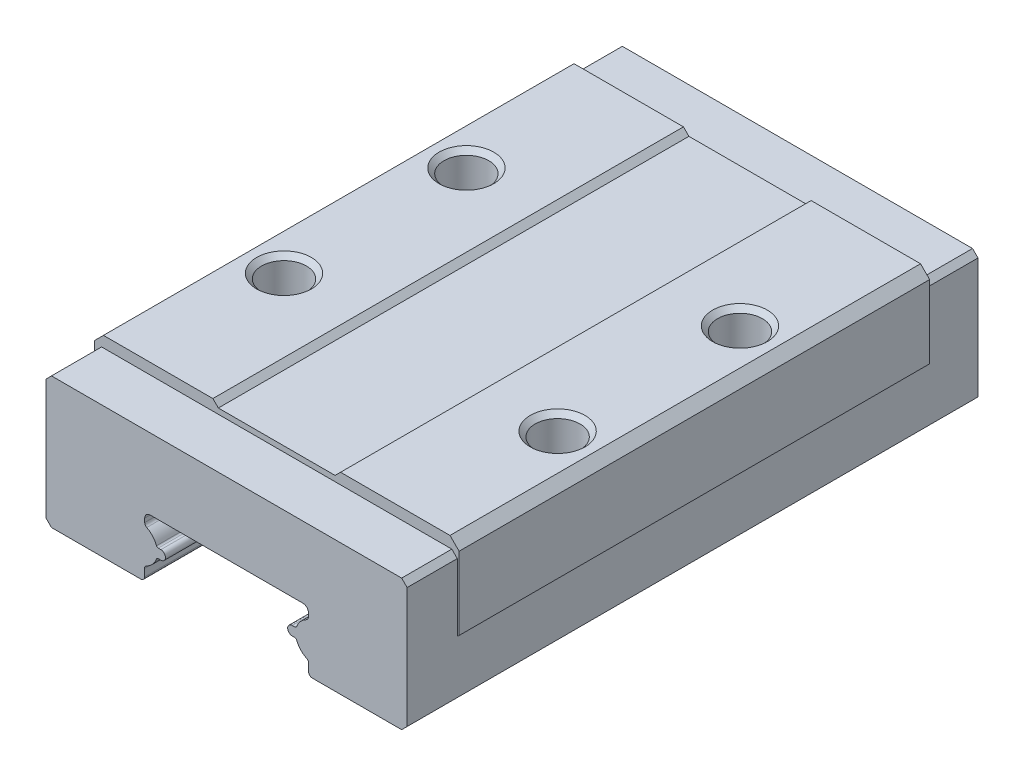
ISO-10303-21;
HEADER;
FILE_DESCRIPTION(('STEP AP214'),'2;1');
FILE_NAME('part.step','',(''),(''),'','','');
FILE_SCHEMA(('AUTOMOTIVE_DESIGN { 1 0 10303 214 1 1 1 1 }'));
ENDSEC;
DATA;
#1=APPLICATION_CONTEXT('core data for automotive mechanical design processes');
#2=APPLICATION_PROTOCOL_DEFINITION('international standard','automotive_design',2000,#1);
#3=PRODUCT_CONTEXT('',#1,'mechanical');
#4=PRODUCT('Part','Part','',(#3));
#5=PRODUCT_RELATED_PRODUCT_CATEGORY('part','',(#4));
#6=PRODUCT_DEFINITION_FORMATION('','',#4);
#7=PRODUCT_DEFINITION_CONTEXT('part definition',#1,'design');
#8=PRODUCT_DEFINITION('design','',#6,#7);
#9=PRODUCT_DEFINITION_SHAPE('','',#8);
#10=(LENGTH_UNIT() NAMED_UNIT(*) SI_UNIT(.MILLI.,.METRE.));
#11=(NAMED_UNIT(*) PLANE_ANGLE_UNIT() SI_UNIT($,.RADIAN.));
#12=(NAMED_UNIT(*) SI_UNIT($,.STERADIAN.) SOLID_ANGLE_UNIT());
#13=UNCERTAINTY_MEASURE_WITH_UNIT(LENGTH_MEASURE(1.E-05),#10,'distance_accuracy_value','');
#14=(GEOMETRIC_REPRESENTATION_CONTEXT(3) GLOBAL_UNCERTAINTY_ASSIGNED_CONTEXT((#13)) GLOBAL_UNIT_ASSIGNED_CONTEXT((#10,
#11,#12)) REPRESENTATION_CONTEXT('',''));
#15=CARTESIAN_POINT('',(0.,0.,0.));
#16=DIRECTION('',(0.,0.,1.));
#17=DIRECTION('',(1.,0.,0.));
#18=AXIS2_PLACEMENT_3D('',#15,#16,#17);
#19=CARTESIAN_POINT('',(-3.747324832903,-6.35,-31.3));
#20=DIRECTION('',(0.,-1.,0.));
#21=DIRECTION('',(0.,0.,-1.));
#22=AXIS2_PLACEMENT_3D('',#19,#20,#21);
#23=PLANE('',#22);
#24=DIRECTION('',(1.,0.,0.));
#25=VECTOR('',#24,1.);
#26=CARTESIAN_POINT('',(-3.747324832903,-6.35,-31.3));
#27=LINE('',#26,#25);
#28=CARTESIAN_POINT('',(-3.74732493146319,-6.35,-31.3));
#29=VERTEX_POINT('',#28);
#30=CARTESIAN_POINT('',(-3.6,-6.35,-31.3));
#31=VERTEX_POINT('',#30);
#32=EDGE_CURVE('E282',#29,#31,#27,.T.);
#33=ORIENTED_EDGE('',*,*,#32,.T.);
#34=DIRECTION('',(0.,0.,-1.));
#35=VECTOR('',#34,1.);
#36=CARTESIAN_POINT('',(-3.6,-6.35,-31.3));
#37=LINE('',#36,#35);
#38=CARTESIAN_POINT('',(-3.6,-6.35,0.));
#39=VERTEX_POINT('',#38);
#40=EDGE_CURVE('E237',#39,#31,#37,.T.);
#41=ORIENTED_EDGE('',*,*,#40,.F.);
#42=DIRECTION('',(1.,0.,0.));
#43=VECTOR('',#42,1.);
#44=CARTESIAN_POINT('',(-3.747324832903,-6.35,0.));
#45=LINE('',#44,#43);
#46=CARTESIAN_POINT('',(-3.74732493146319,-6.35,0.));
#47=VERTEX_POINT('',#46);
#48=EDGE_CURVE('E233',#39,#47,#45,.F.);
#49=ORIENTED_EDGE('',*,*,#48,.T.);
#50=DIRECTION('',(0.,0.,-1.));
#51=VECTOR('',#50,1.);
#52=CARTESIAN_POINT('',(-3.747324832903,-6.35,-31.3));
#53=LINE('',#52,#51);
#54=EDGE_CURVE('E288',#47,#29,#53,.T.);
#55=ORIENTED_EDGE('',*,*,#54,.T.);
#56=EDGE_LOOP('',(#33,#41,#49,#55));
#57=FACE_BOUND('',#56,.T.);
#58=ADVANCED_FACE('F16',(#57),#23,.T.);
#59=CARTESIAN_POINT('',(3.6,-6.35,-31.3));
#60=DIRECTION('',(0.,-1.,0.));
#61=DIRECTION('',(0.,0.,-1.));
#62=AXIS2_PLACEMENT_3D('',#59,#60,#61);
#63=PLANE('',#62);
#64=DIRECTION('',(1.,0.,0.));
#65=VECTOR('',#64,1.);
#66=CARTESIAN_POINT('',(3.6,-6.35,-31.3));
#67=LINE('',#66,#65);
#68=CARTESIAN_POINT('',(3.6,-6.35,-31.3));
#69=VERTEX_POINT('',#68);
#70=CARTESIAN_POINT('',(3.74632460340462,-6.35,-31.3));
#71=VERTEX_POINT('',#70);
#72=EDGE_CURVE('E238',#69,#71,#67,.T.);
#73=ORIENTED_EDGE('',*,*,#72,.T.);
#74=DIRECTION('',(0.,0.,-1.));
#75=VECTOR('',#74,1.);
#76=CARTESIAN_POINT('',(3.746324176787,-6.35,-31.3));
#77=LINE('',#76,#75);
#78=CARTESIAN_POINT('',(3.74632460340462,-6.35,0.));
#79=VERTEX_POINT('',#78);
#80=EDGE_CURVE('E283',#71,#79,#77,.F.);
#81=ORIENTED_EDGE('',*,*,#80,.T.);
#82=DIRECTION('',(1.,0.,0.));
#83=VECTOR('',#82,1.);
#84=CARTESIAN_POINT('',(3.6,-6.35,0.));
#85=LINE('',#84,#83);
#86=CARTESIAN_POINT('',(3.6,-6.35,0.));
#87=VERTEX_POINT('',#86);
#88=EDGE_CURVE('E279',#79,#87,#85,.F.);
#89=ORIENTED_EDGE('',*,*,#88,.T.);
#90=DIRECTION('',(0.,0.,-1.));
#91=VECTOR('',#90,1.);
#92=CARTESIAN_POINT('',(3.6,-6.35,-31.3));
#93=LINE('',#92,#91);
#94=EDGE_CURVE('E253',#69,#87,#93,.F.);
#95=ORIENTED_EDGE('',*,*,#94,.F.);
#96=EDGE_LOOP('',(#73,#81,#89,#95));
#97=FACE_BOUND('',#96,.T.);
#98=ADVANCED_FACE('F1298',(#97),#63,.T.);
#99=CARTESIAN_POINT('',(-3.6,-6.1,-31.3));
#100=DIRECTION('',(0.,0.,-1.));
#101=DIRECTION('',(-1.,0.,0.));
#102=AXIS2_PLACEMENT_3D('',#99,#100,#101);
#103=CYLINDRICAL_SURFACE('',#102,0.25);
#104=CARTESIAN_POINT('',(-3.6,-6.1,-31.3));
#105=DIRECTION('',(0.,0.,-1.));
#106=DIRECTION('',(-1.,0.,0.));
#107=AXIS2_PLACEMENT_3D('',#104,#105,#106);
#108=CIRCLE('',#107,0.25);
#109=CARTESIAN_POINT('',(-3.6,-5.85,-31.3));
#110=VERTEX_POINT('',#109);
#111=EDGE_CURVE('E243',#31,#110,#108,.F.);
#112=ORIENTED_EDGE('',*,*,#111,.T.);
#113=DIRECTION('',(0.,0.,1.));
#114=VECTOR('',#113,1.);
#115=CARTESIAN_POINT('',(-3.6,-5.85,-31.3));
#116=LINE('',#115,#114);
#117=CARTESIAN_POINT('',(-3.6,-5.85,0.));
#118=VERTEX_POINT('',#117);
#119=EDGE_CURVE('E240',#118,#110,#116,.F.);
#120=ORIENTED_EDGE('',*,*,#119,.F.);
#121=CARTESIAN_POINT('',(-3.6,-6.1,0.));
#122=DIRECTION('',(0.,0.,-1.));
#123=DIRECTION('',(-1.,0.,0.));
#124=AXIS2_PLACEMENT_3D('',#121,#122,#123);
#125=CIRCLE('',#124,0.25);
#126=EDGE_CURVE('E19',#118,#39,#125,.T.);
#127=ORIENTED_EDGE('',*,*,#126,.T.);
#128=ORIENTED_EDGE('',*,*,#40,.T.);
#129=EDGE_LOOP('',(#112,#120,#127,#128));
#130=FACE_BOUND('',#129,.T.);
#131=ADVANCED_FACE('F241',(#130),#103,.T.);
#132=CARTESIAN_POINT('',(-3.74732503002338,-6.4499999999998,-31.3));
#133=DIRECTION('',(0.,0.,-1.));
#134=DIRECTION('',(-1.,0.,0.));
#135=AXIS2_PLACEMENT_3D('',#132,#133,#134);
#136=CYLINDRICAL_SURFACE('',#135,0.100000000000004);
#137=DIRECTION('',(0.,0.,-1.));
#138=VECTOR('',#137,1.);
#139=CARTESIAN_POINT('',(-3.84099999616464,-6.41499998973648,-31.3));
#140=LINE('',#139,#138);
#141=CARTESIAN_POINT('',(-3.84099878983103,-6.41499676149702,-31.3));
#142=VERTEX_POINT('',#141);
#143=CARTESIAN_POINT('',(-3.84099878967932,-6.41499676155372,0.));
#144=VERTEX_POINT('',#143);
#145=EDGE_CURVE('E273',#142,#144,#140,.F.);
#146=ORIENTED_EDGE('',*,*,#145,.F.);
#147=CARTESIAN_POINT('',(-3.74732503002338,-6.4499999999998,-31.3));
#148=DIRECTION('',(0.,0.,-1.));
#149=DIRECTION('',(-1.,0.,0.));
#150=AXIS2_PLACEMENT_3D('',#147,#148,#149);
#151=CIRCLE('',#150,0.100000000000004);
#152=EDGE_CURVE('E291',#29,#142,#151,.F.);
#153=ORIENTED_EDGE('',*,*,#152,.F.);
#154=ORIENTED_EDGE('',*,*,#54,.F.);
#155=CARTESIAN_POINT('',(-3.74732503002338,-6.4499999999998,0.));
#156=DIRECTION('',(0.,0.,-1.));
#157=DIRECTION('',(-1.,0.,0.));
#158=AXIS2_PLACEMENT_3D('',#155,#156,#157);
#159=CIRCLE('',#158,0.100000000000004);
#160=EDGE_CURVE('E421',#144,#47,#159,.T.);
#161=ORIENTED_EDGE('',*,*,#160,.F.);
#162=EDGE_LOOP('',(#146,#153,#154,#161));
#163=FACE_BOUND('',#162,.T.);
#164=ADVANCED_FACE('F431',(#163),#136,.F.);
#165=CARTESIAN_POINT('',(3.74632503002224,-6.44999999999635,-31.3));
#166=DIRECTION('',(0.,0.,-1.));
#167=DIRECTION('',(-1.,0.,0.));
#168=AXIS2_PLACEMENT_3D('',#165,#166,#167);
#169=CYLINDRICAL_SURFACE('',#168,0.1);
#170=ORIENTED_EDGE('',*,*,#80,.F.);
#171=CARTESIAN_POINT('',(3.74632503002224,-6.44999999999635,-31.3));
#172=DIRECTION('',(0.,0.,-1.));
#173=DIRECTION('',(-1.,0.,0.));
#174=AXIS2_PLACEMENT_3D('',#171,#172,#173);
#175=CIRCLE('',#174,0.1);
#176=CARTESIAN_POINT('',(3.83999999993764,-6.4149999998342,-31.3));
#177=VERTEX_POINT('',#176);
#178=EDGE_CURVE('E287',#177,#71,#175,.F.);
#179=ORIENTED_EDGE('',*,*,#178,.F.);
#180=DIRECTION('',(0.,0.,-1.));
#181=VECTOR('',#180,1.);
#182=CARTESIAN_POINT('',(3.83999999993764,-6.4149999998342,-31.3));
#183=LINE('',#182,#181);
#184=CARTESIAN_POINT('',(3.83999999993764,-6.4149999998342,0.));
#185=VERTEX_POINT('',#184);
#186=EDGE_CURVE('E268',#185,#177,#183,.T.);
#187=ORIENTED_EDGE('',*,*,#186,.F.);
#188=CARTESIAN_POINT('',(3.74632503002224,-6.44999999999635,0.));
#189=DIRECTION('',(0.,0.,-1.));
#190=DIRECTION('',(-1.,0.,0.));
#191=AXIS2_PLACEMENT_3D('',#188,#189,#190);
#192=CIRCLE('',#191,0.1);
#193=EDGE_CURVE('E286',#79,#185,#192,.T.);
#194=ORIENTED_EDGE('',*,*,#193,.F.);
#195=EDGE_LOOP('',(#170,#179,#187,#194));
#196=FACE_BOUND('',#195,.T.);
#197=ADVANCED_FACE('F1300',(#196),#169,.F.);
#198=CARTESIAN_POINT('',(7.5,-2.99999999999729,-20.65));
#199=DIRECTION('',(0.,1.,0.));
#200=DIRECTION('',(-1.,0.,0.));
#201=AXIS2_PLACEMENT_3D('',#198,#199,#200);
#202=CONICAL_SURFACE('',#201,1.22949999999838,1.04719755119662);
#203=CARTESIAN_POINT('',(7.5,-3.70985215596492,-20.65));
#204=VERTEX_POINT('',#203);
#205=VERTEX_LOOP('',#204);
#206=FACE_BOUND('',#205,.T.);
#207=CARTESIAN_POINT('',(7.5,-3.,-20.65));
#208=DIRECTION('',(0.,-1.,0.));
#209=DIRECTION('',(0.,0.,-1.));
#210=AXIS2_PLACEMENT_3D('',#207,#208,#209);
#211=CIRCLE('',#210,1.2295);
#212=CARTESIAN_POINT('',(7.5,-3.,-21.8795));
#213=VERTEX_POINT('',#212);
#214=EDGE_CURVE('E408',#213,#213,#211,.F.);
#215=ORIENTED_EDGE('',*,*,#214,.T.);
#216=EDGE_LOOP('',(#215));
#217=FACE_BOUND('',#216,.T.);
#218=ADVANCED_FACE('F1354',(#206,#217),#202,.F.);
#219=CARTESIAN_POINT('',(7.5,-2.99999999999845,-10.65));
#220=DIRECTION('',(0.,1.,0.));
#221=DIRECTION('',(-1.,0.,0.));
#222=AXIS2_PLACEMENT_3D('',#219,#220,#221);
#223=CONICAL_SURFACE('',#222,1.22949999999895,1.04719755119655);
#224=CARTESIAN_POINT('',(7.5,-3.70985215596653,-10.65));
#225=VERTEX_POINT('',#224);
#226=VERTEX_LOOP('',#225);
#227=FACE_BOUND('',#226,.T.);
#228=CARTESIAN_POINT('',(7.5,-3.,-10.65));
#229=DIRECTION('',(0.,-1.,0.));
#230=DIRECTION('',(0.,0.,-1.));
#231=AXIS2_PLACEMENT_3D('',#228,#229,#230);
#232=CIRCLE('',#231,1.2295);
#233=CARTESIAN_POINT('',(7.5,-3.,-11.8795));
#234=VERTEX_POINT('',#233);
#235=EDGE_CURVE('E848',#234,#234,#232,.F.);
#236=ORIENTED_EDGE('',*,*,#235,.T.);
#237=EDGE_LOOP('',(#236));
#238=FACE_BOUND('',#237,.T.);
#239=ADVANCED_FACE('F1350',(#227,#238),#223,.F.);
#240=CARTESIAN_POINT('',(-7.5,-2.99999999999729,-20.65));
#241=DIRECTION('',(0.,1.,0.));
#242=DIRECTION('',(-1.,0.,0.));
#243=AXIS2_PLACEMENT_3D('',#240,#241,#242);
#244=CONICAL_SURFACE('',#243,1.22949999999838,1.04719755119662);
#245=CARTESIAN_POINT('',(-7.5,-3.70985215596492,-20.65));
#246=VERTEX_POINT('',#245);
#247=VERTEX_LOOP('',#246);
#248=FACE_BOUND('',#247,.T.);
#249=CARTESIAN_POINT('',(-7.5,-3.,-20.65));
#250=DIRECTION('',(0.,-1.,0.));
#251=DIRECTION('',(0.,0.,-1.));
#252=AXIS2_PLACEMENT_3D('',#249,#250,#251);
#253=CIRCLE('',#252,1.2295);
#254=CARTESIAN_POINT('',(-7.5,-3.,-21.8795));
#255=VERTEX_POINT('',#254);
#256=EDGE_CURVE('E843',#255,#255,#253,.F.);
#257=ORIENTED_EDGE('',*,*,#256,.T.);
#258=EDGE_LOOP('',(#257));
#259=FACE_BOUND('',#258,.T.);
#260=ADVANCED_FACE('F1346',(#248,#259),#244,.F.);
#261=CARTESIAN_POINT('',(-7.5,-2.99999999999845,-10.65));
#262=DIRECTION('',(0.,1.,0.));
#263=DIRECTION('',(-1.,0.,0.));
#264=AXIS2_PLACEMENT_3D('',#261,#262,#263);
#265=CONICAL_SURFACE('',#264,1.22949999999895,1.04719755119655);
#266=CARTESIAN_POINT('',(-7.5,-3.70985215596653,-10.65));
#267=VERTEX_POINT('',#266);
#268=VERTEX_LOOP('',#267);
#269=FACE_BOUND('',#268,.T.);
#270=CARTESIAN_POINT('',(-7.5,-3.,-10.65));
#271=DIRECTION('',(0.,-1.,0.));
#272=DIRECTION('',(0.,0.,-1.));
#273=AXIS2_PLACEMENT_3D('',#270,#271,#272);
#274=CIRCLE('',#273,1.2295);
#275=CARTESIAN_POINT('',(-7.5,-3.,-11.8795));
#276=VERTEX_POINT('',#275);
#277=EDGE_CURVE('E838',#276,#276,#274,.F.);
#278=ORIENTED_EDGE('',*,*,#277,.T.);
#279=EDGE_LOOP('',(#278));
#280=FACE_BOUND('',#279,.T.);
#281=ADVANCED_FACE('F1343',(#269,#280),#265,.F.);
#282=CARTESIAN_POINT('',(3.6,-6.1,-31.3));
#283=DIRECTION('',(0.,0.,-1.));
#284=DIRECTION('',(-1.,0.,0.));
#285=AXIS2_PLACEMENT_3D('',#282,#283,#284);
#286=CYLINDRICAL_SURFACE('',#285,0.25);
#287=CARTESIAN_POINT('',(3.6,-6.1,-31.3));
#288=DIRECTION('',(0.,0.,-1.));
#289=DIRECTION('',(-1.,0.,0.));
#290=AXIS2_PLACEMENT_3D('',#287,#288,#289);
#291=CIRCLE('',#290,0.25);
#292=CARTESIAN_POINT('',(3.6,-5.85,-31.3));
#293=VERTEX_POINT('',#292);
#294=EDGE_CURVE('E256',#293,#69,#291,.F.);
#295=ORIENTED_EDGE('',*,*,#294,.T.);
#296=ORIENTED_EDGE('',*,*,#94,.T.);
#297=CARTESIAN_POINT('',(3.6,-6.1,0.));
#298=DIRECTION('',(0.,0.,-1.));
#299=DIRECTION('',(-1.,0.,0.));
#300=AXIS2_PLACEMENT_3D('',#297,#298,#299);
#301=CIRCLE('',#300,0.25);
#302=CARTESIAN_POINT('',(3.6,-5.85,0.));
#303=VERTEX_POINT('',#302);
#304=EDGE_CURVE('E416',#87,#303,#301,.T.);
#305=ORIENTED_EDGE('',*,*,#304,.T.);
#306=DIRECTION('',(0.,0.,1.));
#307=VECTOR('',#306,1.);
#308=CARTESIAN_POINT('',(3.6,-5.85,-31.3));
#309=LINE('',#308,#307);
#310=EDGE_CURVE('E263',#293,#303,#309,.T.);
#311=ORIENTED_EDGE('',*,*,#310,.F.);
#312=EDGE_LOOP('',(#295,#296,#305,#311));
#313=FACE_BOUND('',#312,.T.);
#314=ADVANCED_FACE('F1302',(#313),#286,.T.);
#315=CARTESIAN_POINT('',(-3.6,-5.85,-31.3));
#316=DIRECTION('',(0.,1.,0.));
#317=DIRECTION('',(0.,0.,1.));
#318=AXIS2_PLACEMENT_3D('',#315,#316,#317);
#319=PLANE('',#318);
#320=DIRECTION('',(1.,0.,0.));
#321=VECTOR('',#320,1.);
#322=CARTESIAN_POINT('',(-3.6,-5.85,-31.3));
#323=LINE('',#322,#321);
#324=CARTESIAN_POINT('',(-3.74732493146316,-5.85,-31.3));
#325=VERTEX_POINT('',#324);
#326=EDGE_CURVE('E247',#110,#325,#323,.F.);
#327=ORIENTED_EDGE('',*,*,#326,.T.);
#328=DIRECTION('',(0.,0.,-1.));
#329=VECTOR('',#328,1.);
#330=CARTESIAN_POINT('',(-3.747324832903,-5.85,-31.3));
#331=LINE('',#330,#329);
#332=CARTESIAN_POINT('',(-3.74732493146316,-5.85,0.));
#333=VERTEX_POINT('',#332);
#334=EDGE_CURVE('E251',#325,#333,#331,.F.);
#335=ORIENTED_EDGE('',*,*,#334,.T.);
#336=DIRECTION('',(1.,0.,0.));
#337=VECTOR('',#336,1.);
#338=CARTESIAN_POINT('',(-3.6,-5.85,0.));
#339=LINE('',#338,#337);
#340=EDGE_CURVE('E230',#333,#118,#339,.T.);
#341=ORIENTED_EDGE('',*,*,#340,.T.);
#342=ORIENTED_EDGE('',*,*,#119,.T.);
#343=EDGE_LOOP('',(#327,#335,#341,#342));
#344=FACE_BOUND('',#343,.T.);
#345=ADVANCED_FACE('F249',(#344),#319,.T.);
#346=CARTESIAN_POINT('',(-4.87138843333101,-6.02990302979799,-31.3));
#347=DIRECTION('',(0.,0.,-1.));
#348=DIRECTION('',(-1.,0.,0.));
#349=AXIS2_PLACEMENT_3D('',#346,#347,#348);
#350=CYLINDRICAL_SURFACE('',#349,1.1);
#351=CARTESIAN_POINT('',(-4.87138843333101,-6.02990302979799,-31.3));
#352=DIRECTION('',(0.,0.,-1.));
#353=DIRECTION('',(-1.,0.,0.));
#354=AXIS2_PLACEMENT_3D('',#351,#352,#353);
#355=CIRCLE('',#354,1.1);
#356=CARTESIAN_POINT('',(-4.38799999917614,-7.01799999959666,-31.3));
#357=VERTEX_POINT('',#356);
#358=EDGE_CURVE('E275',#357,#142,#355,.F.);
#359=ORIENTED_EDGE('',*,*,#358,.T.);
#360=ORIENTED_EDGE('',*,*,#145,.T.);
#361=CARTESIAN_POINT('',(-4.87138843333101,-6.02990302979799,0.));
#362=DIRECTION('',(0.,0.,-1.));
#363=DIRECTION('',(-1.,0.,0.));
#364=AXIS2_PLACEMENT_3D('',#361,#362,#363);
#365=CIRCLE('',#364,1.1);
#366=CARTESIAN_POINT('',(-4.38799999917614,-7.01799999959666,0.));
#367=VERTEX_POINT('',#366);
#368=EDGE_CURVE('E262',#144,#367,#365,.T.);
#369=ORIENTED_EDGE('',*,*,#368,.T.);
#370=DIRECTION('',(0.,0.,-1.));
#371=VECTOR('',#370,1.);
#372=CARTESIAN_POINT('',(-4.38799999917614,-7.01799999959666,-31.3));
#373=LINE('',#372,#371);
#374=EDGE_CURVE('E402',#367,#357,#373,.T.);
#375=ORIENTED_EDGE('',*,*,#374,.T.);
#376=EDGE_LOOP('',(#359,#360,#369,#375));
#377=FACE_BOUND('',#376,.T.);
#378=ADVANCED_FACE('F433',(#377),#350,.T.);
#379=CARTESIAN_POINT('',(4.87016487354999,-6.02930538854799,-31.3));
#380=DIRECTION('',(0.,0.,-1.));
#381=DIRECTION('',(-1.,0.,0.));
#382=AXIS2_PLACEMENT_3D('',#379,#380,#381);
#383=CYLINDRICAL_SURFACE('',#382,1.1);
#384=CARTESIAN_POINT('',(4.87016487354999,-6.02930538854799,-31.3));
#385=DIRECTION('',(0.,0.,-1.));
#386=DIRECTION('',(-1.,0.,0.));
#387=AXIS2_PLACEMENT_3D('',#384,#385,#386);
#388=CIRCLE('',#387,1.1);
#389=CARTESIAN_POINT('',(4.38799999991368,-7.01799999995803,-31.3));
#390=VERTEX_POINT('',#389);
#391=EDGE_CURVE('E271',#177,#390,#388,.F.);
#392=ORIENTED_EDGE('',*,*,#391,.T.);
#393=DIRECTION('',(0.,0.,-1.));
#394=VECTOR('',#393,1.);
#395=CARTESIAN_POINT('',(4.38799999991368,-7.01799999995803,-31.3));
#396=LINE('',#395,#394);
#397=CARTESIAN_POINT('',(4.38799999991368,-7.01799999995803,0.));
#398=VERTEX_POINT('',#397);
#399=EDGE_CURVE('E394',#390,#398,#396,.F.);
#400=ORIENTED_EDGE('',*,*,#399,.T.);
#401=CARTESIAN_POINT('',(4.87016487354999,-6.02930538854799,0.));
#402=DIRECTION('',(0.,0.,-1.));
#403=DIRECTION('',(-1.,0.,0.));
#404=AXIS2_PLACEMENT_3D('',#401,#402,#403);
#405=CIRCLE('',#404,1.1);
#406=EDGE_CURVE('E272',#398,#185,#405,.T.);
#407=ORIENTED_EDGE('',*,*,#406,.T.);
#408=ORIENTED_EDGE('',*,*,#186,.T.);
#409=EDGE_LOOP('',(#392,#400,#407,#408));
#410=FACE_BOUND('',#409,.T.);
#411=ADVANCED_FACE('F1292',(#410),#383,.T.);
#412=CARTESIAN_POINT('',(7.5,0.,-20.65));
#413=DIRECTION('',(0.,-1.,0.));
#414=DIRECTION('',(0.,0.,-1.));
#415=AXIS2_PLACEMENT_3D('',#412,#413,#414);
#416=CYLINDRICAL_SURFACE('',#415,1.2295);
#417=ORIENTED_EDGE('',*,*,#214,.F.);
#418=EDGE_LOOP('',(#417));
#419=FACE_BOUND('',#418,.T.);
#420=CARTESIAN_POINT('',(7.5,-0.270499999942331,-20.65));
#421=DIRECTION('',(0.,1.,0.));
#422=DIRECTION('',(0.,0.,1.));
#423=AXIS2_PLACEMENT_3D('',#420,#421,#422);
#424=CIRCLE('',#423,1.22950000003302);
#425=CARTESIAN_POINT('',(7.5,-0.270499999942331,-19.420499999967));
#426=VERTEX_POINT('',#425);
#427=EDGE_CURVE('E809',#426,#426,#424,.T.);
#428=ORIENTED_EDGE('',*,*,#427,.T.);
#429=EDGE_LOOP('',(#428));
#430=FACE_BOUND('',#429,.T.);
#431=ADVANCED_FACE('F1330',(#419,#430),#416,.F.);
#432=CARTESIAN_POINT('',(7.5,0.,-10.65));
#433=DIRECTION('',(0.,-1.,0.));
#434=DIRECTION('',(0.,0.,-1.));
#435=AXIS2_PLACEMENT_3D('',#432,#433,#434);
#436=CYLINDRICAL_SURFACE('',#435,1.2295);
#437=ORIENTED_EDGE('',*,*,#235,.F.);
#438=EDGE_LOOP('',(#437));
#439=FACE_BOUND('',#438,.T.);
#440=CARTESIAN_POINT('',(7.5,-0.270499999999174,-10.65));
#441=DIRECTION('',(0.,1.,0.));
#442=DIRECTION('',(0.,0.,1.));
#443=AXIS2_PLACEMENT_3D('',#440,#441,#442);
#444=CIRCLE('',#443,1.22949999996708);
#445=CARTESIAN_POINT('',(7.5,-0.270499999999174,-9.42050000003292));
#446=VERTEX_POINT('',#445);
#447=EDGE_CURVE('E806',#446,#446,#444,.T.);
#448=ORIENTED_EDGE('',*,*,#447,.T.);
#449=EDGE_LOOP('',(#448));
#450=FACE_BOUND('',#449,.T.);
#451=ADVANCED_FACE('F1326',(#439,#450),#436,.F.);
#452=CARTESIAN_POINT('',(-7.5,0.,-20.65));
#453=DIRECTION('',(0.,-1.,0.));
#454=DIRECTION('',(0.,0.,-1.));
#455=AXIS2_PLACEMENT_3D('',#452,#453,#454);
#456=CYLINDRICAL_SURFACE('',#455,1.2295);
#457=ORIENTED_EDGE('',*,*,#256,.F.);
#458=EDGE_LOOP('',(#457));
#459=FACE_BOUND('',#458,.T.);
#460=CARTESIAN_POINT('',(-7.5,-0.270499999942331,-20.65));
#461=DIRECTION('',(0.,1.,0.));
#462=DIRECTION('',(0.,0.,1.));
#463=AXIS2_PLACEMENT_3D('',#460,#461,#462);
#464=CIRCLE('',#463,1.22950000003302);
#465=CARTESIAN_POINT('',(-7.5,-0.270499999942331,-19.420499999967));
#466=VERTEX_POINT('',#465);
#467=EDGE_CURVE('E785',#466,#466,#464,.T.);
#468=ORIENTED_EDGE('',*,*,#467,.T.);
#469=EDGE_LOOP('',(#468));
#470=FACE_BOUND('',#469,.T.);
#471=ADVANCED_FACE('F1320',(#459,#470),#456,.F.);
#472=CARTESIAN_POINT('',(-7.5,0.,-10.65));
#473=DIRECTION('',(0.,-1.,0.));
#474=DIRECTION('',(0.,0.,-1.));
#475=AXIS2_PLACEMENT_3D('',#472,#473,#474);
#476=CYLINDRICAL_SURFACE('',#475,1.2295);
#477=ORIENTED_EDGE('',*,*,#277,.F.);
#478=EDGE_LOOP('',(#477));
#479=FACE_BOUND('',#478,.T.);
#480=CARTESIAN_POINT('',(-7.5,-0.270499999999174,-10.65));
#481=DIRECTION('',(0.,1.,0.));
#482=DIRECTION('',(0.,0.,1.));
#483=AXIS2_PLACEMENT_3D('',#480,#481,#482);
#484=CIRCLE('',#483,1.22949999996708);
#485=CARTESIAN_POINT('',(-7.5,-0.270499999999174,-9.42050000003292));
#486=VERTEX_POINT('',#485);
#487=EDGE_CURVE('E782',#486,#486,#484,.T.);
#488=ORIENTED_EDGE('',*,*,#487,.T.);
#489=EDGE_LOOP('',(#488));
#490=FACE_BOUND('',#489,.T.);
#491=ADVANCED_FACE('F1312',(#479,#490),#476,.F.);
#492=CARTESIAN_POINT('',(3.746324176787,-5.85,-31.3));
#493=DIRECTION('',(0.,1.,0.));
#494=DIRECTION('',(0.,0.,1.));
#495=AXIS2_PLACEMENT_3D('',#492,#493,#494);
#496=PLANE('',#495);
#497=DIRECTION('',(1.,0.,0.));
#498=VECTOR('',#497,1.);
#499=CARTESIAN_POINT('',(3.746324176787,-5.85,-31.3));
#500=LINE('',#499,#498);
#501=CARTESIAN_POINT('',(3.74632460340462,-5.85,-31.3));
#502=VERTEX_POINT('',#501);
#503=EDGE_CURVE('E267',#502,#293,#500,.F.);
#504=ORIENTED_EDGE('',*,*,#503,.T.);
#505=ORIENTED_EDGE('',*,*,#310,.T.);
#506=DIRECTION('',(1.,0.,0.));
#507=VECTOR('',#506,1.);
#508=CARTESIAN_POINT('',(3.746324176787,-5.85,0.));
#509=LINE('',#508,#507);
#510=CARTESIAN_POINT('',(3.74632460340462,-5.85,0.));
#511=VERTEX_POINT('',#510);
#512=EDGE_CURVE('E836',#303,#511,#509,.T.);
#513=ORIENTED_EDGE('',*,*,#512,.T.);
#514=DIRECTION('',(0.,0.,-1.));
#515=VECTOR('',#514,1.);
#516=CARTESIAN_POINT('',(3.746324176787,-5.85,-31.3));
#517=LINE('',#516,#515);
#518=EDGE_CURVE('E370',#511,#502,#517,.T.);
#519=ORIENTED_EDGE('',*,*,#518,.T.);
#520=EDGE_LOOP('',(#504,#505,#513,#519));
#521=FACE_BOUND('',#520,.T.);
#522=ADVANCED_FACE('F1308',(#521),#496,.T.);
#523=CARTESIAN_POINT('',(-3.74732503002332,-5.75000000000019,-31.3));
#524=DIRECTION('',(0.,0.,-1.));
#525=DIRECTION('',(-1.,0.,0.));
#526=AXIS2_PLACEMENT_3D('',#523,#524,#525);
#527=CYLINDRICAL_SURFACE('',#526,0.100000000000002);
#528=ORIENTED_EDGE('',*,*,#334,.F.);
#529=CARTESIAN_POINT('',(-3.74732503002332,-5.75000000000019,-31.3));
#530=DIRECTION('',(0.,0.,-1.));
#531=DIRECTION('',(-1.,0.,0.));
#532=AXIS2_PLACEMENT_3D('',#529,#530,#531);
#533=CIRCLE('',#532,0.100000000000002);
#534=CARTESIAN_POINT('',(-3.84099999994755,-5.78500000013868,-31.3));
#535=VERTEX_POINT('',#534);
#536=EDGE_CURVE('E266',#535,#325,#533,.F.);
#537=ORIENTED_EDGE('',*,*,#536,.F.);
#538=DIRECTION('',(0.,0.,-1.));
#539=VECTOR('',#538,1.);
#540=CARTESIAN_POINT('',(-3.84099999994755,-5.78500000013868,-31.3));
#541=LINE('',#540,#539);
#542=CARTESIAN_POINT('',(-3.84099999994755,-5.78500000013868,0.));
#543=VERTEX_POINT('',#542);
#544=EDGE_CURVE('E361',#543,#535,#541,.T.);
#545=ORIENTED_EDGE('',*,*,#544,.F.);
#546=CARTESIAN_POINT('',(-3.74732503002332,-5.75000000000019,0.));
#547=DIRECTION('',(0.,0.,-1.));
#548=DIRECTION('',(-1.,0.,0.));
#549=AXIS2_PLACEMENT_3D('',#546,#547,#548);
#550=CIRCLE('',#549,0.100000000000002);
#551=EDGE_CURVE('E403',#333,#543,#550,.T.);
#552=ORIENTED_EDGE('',*,*,#551,.F.);
#553=EDGE_LOOP('',(#528,#537,#545,#552));
#554=FACE_BOUND('',#553,.T.);
#555=ADVANCED_FACE('F1151',(#554),#527,.F.);
#556=CARTESIAN_POINT('',(-4.30000000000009,-7.19759955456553,-31.3));
#557=DIRECTION('',(0.,0.,-1.));
#558=DIRECTION('',(-1.,0.,0.));
#559=AXIS2_PLACEMENT_3D('',#556,#557,#558);
#560=CYLINDRICAL_SURFACE('',#559,0.200000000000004);
#561=DIRECTION('',(0.,0.,-1.));
#562=VECTOR('',#561,1.);
#563=CARTESIAN_POINT('',(-4.5,-7.197599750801,-31.3));
#564=LINE('',#563,#562);
#565=CARTESIAN_POINT('',(-4.5,-7.19759965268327,-31.3));
#566=VERTEX_POINT('',#565);
#567=CARTESIAN_POINT('',(-4.5,-7.19759965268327,0.));
#568=VERTEX_POINT('',#567);
#569=EDGE_CURVE('E441',#566,#568,#564,.F.);
#570=ORIENTED_EDGE('',*,*,#569,.F.);
#571=CARTESIAN_POINT('',(-4.30000000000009,-7.19759955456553,-31.3));
#572=DIRECTION('',(0.,0.,-1.));
#573=DIRECTION('',(-1.,0.,0.));
#574=AXIS2_PLACEMENT_3D('',#571,#572,#573);
#575=CIRCLE('',#574,0.200000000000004);
#576=EDGE_CURVE('E400',#357,#566,#575,.F.);
#577=ORIENTED_EDGE('',*,*,#576,.F.);
#578=ORIENTED_EDGE('',*,*,#374,.F.);
#579=CARTESIAN_POINT('',(-4.30000000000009,-7.19759955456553,0.));
#580=DIRECTION('',(0.,0.,-1.));
#581=DIRECTION('',(-1.,0.,0.));
#582=AXIS2_PLACEMENT_3D('',#579,#580,#581);
#583=CIRCLE('',#582,0.200000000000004);
#584=EDGE_CURVE('E397',#568,#367,#583,.T.);
#585=ORIENTED_EDGE('',*,*,#584,.F.);
#586=EDGE_LOOP('',(#570,#577,#578,#585));
#587=FACE_BOUND('',#586,.T.);
#588=ADVANCED_FACE('F439',(#587),#560,.F.);
#589=CARTESIAN_POINT('',(4.3000000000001,-7.19759955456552,-31.3));
#590=DIRECTION('',(0.,0.,-1.));
#591=DIRECTION('',(-1.,0.,0.));
#592=AXIS2_PLACEMENT_3D('',#589,#590,#591);
#593=CYLINDRICAL_SURFACE('',#592,0.199999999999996);
#594=ORIENTED_EDGE('',*,*,#399,.F.);
#595=CARTESIAN_POINT('',(4.3000000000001,-7.19759955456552,-31.3));
#596=DIRECTION('',(0.,0.,-1.));
#597=DIRECTION('',(-1.,0.,0.));
#598=AXIS2_PLACEMENT_3D('',#595,#596,#597);
#599=CIRCLE('',#598,0.199999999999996);
#600=CARTESIAN_POINT('',(4.5,-7.19759947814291,-31.3));
#601=VERTEX_POINT('',#600);
#602=EDGE_CURVE('E395',#601,#390,#599,.F.);
#603=ORIENTED_EDGE('',*,*,#602,.F.);
#604=DIRECTION('',(0.,0.,1.));
#605=VECTOR('',#604,1.);
#606=CARTESIAN_POINT('',(4.5,-7.1975994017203,-31.3));
#607=LINE('',#606,#605);
#608=CARTESIAN_POINT('',(4.5,-7.19759947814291,0.));
#609=VERTEX_POINT('',#608);
#610=EDGE_CURVE('E757',#609,#601,#607,.F.);
#611=ORIENTED_EDGE('',*,*,#610,.F.);
#612=CARTESIAN_POINT('',(4.3000000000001,-7.19759955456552,0.));
#613=DIRECTION('',(0.,0.,-1.));
#614=DIRECTION('',(-1.,0.,0.));
#615=AXIS2_PLACEMENT_3D('',#612,#613,#614);
#616=CIRCLE('',#615,0.199999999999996);
#617=EDGE_CURVE('E392',#398,#609,#616,.T.);
#618=ORIENTED_EDGE('',*,*,#617,.F.);
#619=EDGE_LOOP('',(#594,#603,#611,#618));
#620=FACE_BOUND('',#619,.T.);
#621=ADVANCED_FACE('F893',(#620),#593,.F.);
#622=CARTESIAN_POINT('',(-10.249949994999,-2.5,-2.75));
#623=DIRECTION('',(0.,0.,1.));
#624=DIRECTION('',(1.,0.,0.));
#625=AXIS2_PLACEMENT_3D('',#622,#623,#624);
#626=CYLINDRICAL_SURFACE('',#625,0.35);
#627=DIRECTION('',(0.,0.,1.));
#628=VECTOR('',#627,1.);
#629=CARTESIAN_POINT('',(-10.,-2.745,-31.3));
#630=LINE('',#629,#628);
#631=CARTESIAN_POINT('',(-10.,-2.745,-2.75));
#632=VERTEX_POINT('',#631);
#633=CARTESIAN_POINT('',(-10.,-2.745,-28.55));
#634=VERTEX_POINT('',#633);
#635=EDGE_CURVE('E360',#632,#634,#630,.F.);
#636=ORIENTED_EDGE('',*,*,#635,.F.);
#637=CARTESIAN_POINT('',(-10.249949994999,-2.5,-2.75));
#638=DIRECTION('',(0.,0.,1.));
#639=DIRECTION('',(1.,0.,0.));
#640=AXIS2_PLACEMENT_3D('',#637,#638,#639);
#641=CIRCLE('',#640,0.35);
#642=CARTESIAN_POINT('',(-9.9,-2.50591616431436,-2.75));
#643=VERTEX_POINT('',#642);
#644=EDGE_CURVE('E375',#643,#632,#641,.F.);
#645=ORIENTED_EDGE('',*,*,#644,.F.);
#646=CARTESIAN_POINT('',(-9.9,-2.49408383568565,-2.75));
#647=DIRECTION('',(0.,-1.,0.));
#648=VECTOR('',#647,1.);
#649=LINE('',#646,#648);
#650=CARTESIAN_POINT('',(-9.9,-2.49408383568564,-2.75));
#651=VERTEX_POINT('',#650);
#652=EDGE_CURVE('E379',#651,#643,#649,.T.);
#653=ORIENTED_EDGE('',*,*,#652,.F.);
#654=CARTESIAN_POINT('',(-10.249949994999,-2.5,-2.75));
#655=DIRECTION('',(0.,0.,1.));
#656=DIRECTION('',(1.,0.,0.));
#657=AXIS2_PLACEMENT_3D('',#654,#655,#656);
#658=CIRCLE('',#657,0.35);
#659=CARTESIAN_POINT('',(-10.,-2.255,-2.75));
#660=VERTEX_POINT('',#659);
#661=EDGE_CURVE('E382',#660,#651,#658,.F.);
#662=ORIENTED_EDGE('',*,*,#661,.F.);
#663=DIRECTION('',(0.,0.,1.));
#664=VECTOR('',#663,1.);
#665=CARTESIAN_POINT('',(-10.,-2.255,-31.3));
#666=LINE('',#665,#664);
#667=CARTESIAN_POINT('',(-10.,-2.255,-28.55));
#668=VERTEX_POINT('',#667);
#669=EDGE_CURVE('E725',#668,#660,#666,.T.);
#670=ORIENTED_EDGE('',*,*,#669,.F.);
#671=CARTESIAN_POINT('',(-10.249949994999,-2.5,-28.55));
#672=DIRECTION('',(0.,0.,1.));
#673=DIRECTION('',(1.,0.,0.));
#674=AXIS2_PLACEMENT_3D('',#671,#672,#673);
#675=CIRCLE('',#674,0.35);
#676=CARTESIAN_POINT('',(-9.9,-2.49408383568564,-28.55));
#677=VERTEX_POINT('',#676);
#678=EDGE_CURVE('E385',#677,#668,#675,.T.);
#679=ORIENTED_EDGE('',*,*,#678,.F.);
#680=CARTESIAN_POINT('',(-9.9,-2.50591616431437,-28.55));
#681=DIRECTION('',(0.,1.,0.));
#682=VECTOR('',#681,1.);
#683=LINE('',#680,#682);
#684=CARTESIAN_POINT('',(-9.9,-2.50591616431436,-28.55));
#685=VERTEX_POINT('',#684);
#686=EDGE_CURVE('E389',#685,#677,#683,.T.);
#687=ORIENTED_EDGE('',*,*,#686,.F.);
#688=CARTESIAN_POINT('',(-10.249949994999,-2.5,-28.55));
#689=DIRECTION('',(0.,0.,1.));
#690=DIRECTION('',(1.,0.,0.));
#691=AXIS2_PLACEMENT_3D('',#688,#689,#690);
#692=CIRCLE('',#691,0.35);
#693=EDGE_CURVE('E371',#634,#685,#692,.T.);
#694=ORIENTED_EDGE('',*,*,#693,.F.);
#695=EDGE_LOOP('',(#636,#645,#653,#662,#670,#679,#687,#694));
#696=FACE_BOUND('',#695,.T.);
#697=ADVANCED_FACE('F882',(#696),#626,.F.);
#698=CARTESIAN_POINT('',(10.,-0.5,-31.3));
#699=DIRECTION('',(0.707106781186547,0.707106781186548,0.));
#700=DIRECTION('',(-0.707106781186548,0.707106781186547,0.));
#701=AXIS2_PLACEMENT_3D('',#698,#699,#700);
#702=PLANE('',#701);
#703=DIRECTION('',(-0.707106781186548,0.707106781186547,0.));
#704=VECTOR('',#703,1.);
#705=CARTESIAN_POINT('',(10.,-0.5,-2.75));
#706=LINE('',#705,#704);
#707=CARTESIAN_POINT('',(9.5,0.,-2.75));
#708=VERTEX_POINT('',#707);
#709=CARTESIAN_POINT('',(10.,-0.5,-2.75));
#710=VERTEX_POINT('',#709);
#711=EDGE_CURVE('E814',#708,#710,#706,.F.);
#712=ORIENTED_EDGE('',*,*,#711,.T.);
#713=DIRECTION('',(0.,0.,-1.));
#714=VECTOR('',#713,1.);
#715=CARTESIAN_POINT('',(10.,-0.5,-31.3));
#716=LINE('',#715,#714);
#717=CARTESIAN_POINT('',(10.,-0.5,-28.55));
#718=VERTEX_POINT('',#717);
#719=EDGE_CURVE('E713',#718,#710,#716,.F.);
#720=ORIENTED_EDGE('',*,*,#719,.F.);
#721=DIRECTION('',(-0.707106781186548,0.707106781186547,0.));
#722=VECTOR('',#721,1.);
#723=CARTESIAN_POINT('',(10.,-0.5,-28.55));
#724=LINE('',#723,#722);
#725=CARTESIAN_POINT('',(9.5,0.,-28.55));
#726=VERTEX_POINT('',#725);
#727=EDGE_CURVE('E374',#718,#726,#724,.T.);
#728=ORIENTED_EDGE('',*,*,#727,.T.);
#729=DIRECTION('',(0.,0.,1.));
#730=VECTOR('',#729,1.);
#731=CARTESIAN_POINT('',(9.5,0.,-31.3));
#732=LINE('',#731,#730);
#733=EDGE_CURVE('E356',#708,#726,#732,.F.);
#734=ORIENTED_EDGE('',*,*,#733,.F.);
#735=EDGE_LOOP('',(#712,#720,#728,#734));
#736=FACE_BOUND('',#735,.T.);
#737=ADVANCED_FACE('F892',(#736),#702,.T.);
#738=CARTESIAN_POINT('',(7.5,-5.6843418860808E-11,-20.65));
#739=DIRECTION('',(0.,1.,0.));
#740=DIRECTION('',(0.,0.,1.));
#741=AXIS2_PLACEMENT_3D('',#738,#739,#740);
#742=CONICAL_SURFACE('',#741,1.49999999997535,0.785398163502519);
#743=ORIENTED_EDGE('',*,*,#427,.F.);
#744=EDGE_LOOP('',(#743));
#745=FACE_BOUND('',#744,.T.);
#746=CARTESIAN_POINT('',(7.5,-5.6843418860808E-11,-20.65));
#747=DIRECTION('',(0.,1.,0.));
#748=DIRECTION('',(0.,0.,1.));
#749=AXIS2_PLACEMENT_3D('',#746,#747,#748);
#750=CIRCLE('',#749,1.49999999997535);
#751=CARTESIAN_POINT('',(7.5,-5.6843418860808E-11,-19.1500000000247));
#752=VERTEX_POINT('',#751);
#753=EDGE_CURVE('E353',#752,#752,#750,.F.);
#754=ORIENTED_EDGE('',*,*,#753,.F.);
#755=EDGE_LOOP('',(#754));
#756=FACE_BOUND('',#755,.T.);
#757=ADVANCED_FACE('F1074',(#745,#756),#742,.F.);
#758=CARTESIAN_POINT('',(7.5,0.,-10.65));
#759=DIRECTION('',(0.,1.,0.));
#760=DIRECTION('',(0.,0.,1.));
#761=AXIS2_PLACEMENT_3D('',#758,#759,#760);
#762=CONICAL_SURFACE('',#761,1.49999999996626,0.785398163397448);
#763=ORIENTED_EDGE('',*,*,#447,.F.);
#764=EDGE_LOOP('',(#763));
#765=FACE_BOUND('',#764,.T.);
#766=CARTESIAN_POINT('',(7.5,0.,-10.65));
#767=DIRECTION('',(0.,1.,0.));
#768=DIRECTION('',(0.,0.,1.));
#769=AXIS2_PLACEMENT_3D('',#766,#767,#768);
#770=CIRCLE('',#769,1.49999999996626);
#771=CARTESIAN_POINT('',(7.5,0.,-9.15000000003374));
#772=VERTEX_POINT('',#771);
#773=EDGE_CURVE('E349',#772,#772,#770,.F.);
#774=ORIENTED_EDGE('',*,*,#773,.F.);
#775=EDGE_LOOP('',(#774));
#776=FACE_BOUND('',#775,.T.);
#777=ADVANCED_FACE('F1071',(#765,#776),#762,.F.);
#778=CARTESIAN_POINT('',(3.5,0.,-31.3));
#779=DIRECTION('',(-0.707106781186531,0.707106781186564,0.));
#780=DIRECTION('',(-0.707106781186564,-0.707106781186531,0.));
#781=AXIS2_PLACEMENT_3D('',#778,#779,#780);
#782=PLANE('',#781);
#783=DIRECTION('',(-0.707106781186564,-0.707106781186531,0.));
#784=VECTOR('',#783,1.);
#785=CARTESIAN_POINT('',(3.5,0.,-2.75));
#786=LINE('',#785,#784);
#787=CARTESIAN_POINT('',(3.2,-0.299999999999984,-2.75));
#788=VERTEX_POINT('',#787);
#789=CARTESIAN_POINT('',(3.5,0.,-2.75));
#790=VERTEX_POINT('',#789);
#791=EDGE_CURVE('E799',#788,#790,#786,.F.);
#792=ORIENTED_EDGE('',*,*,#791,.T.);
#793=DIRECTION('',(0.,0.,1.));
#794=VECTOR('',#793,1.);
#795=CARTESIAN_POINT('',(3.5,0.,-31.3));
#796=LINE('',#795,#794);
#797=CARTESIAN_POINT('',(3.5,0.,-28.55));
#798=VERTEX_POINT('',#797);
#799=EDGE_CURVE('E710',#798,#790,#796,.T.);
#800=ORIENTED_EDGE('',*,*,#799,.F.);
#801=DIRECTION('',(-0.707106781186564,-0.707106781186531,0.));
#802=VECTOR('',#801,1.);
#803=CARTESIAN_POINT('',(3.5,0.,-28.55));
#804=LINE('',#803,#802);
#805=CARTESIAN_POINT('',(3.2,-0.299999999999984,-28.55));
#806=VERTEX_POINT('',#805);
#807=EDGE_CURVE('E803',#798,#806,#804,.T.);
#808=ORIENTED_EDGE('',*,*,#807,.T.);
#809=DIRECTION('',(0.,0.,1.));
#810=VECTOR('',#809,1.);
#811=CARTESIAN_POINT('',(3.2,-0.299999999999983,-31.3));
#812=LINE('',#811,#810);
#813=EDGE_CURVE('E703',#788,#806,#812,.F.);
#814=ORIENTED_EDGE('',*,*,#813,.F.);
#815=EDGE_LOOP('',(#792,#800,#808,#814));
#816=FACE_BOUND('',#815,.T.);
#817=ADVANCED_FACE('F1067',(#816),#782,.T.);
#818=CARTESIAN_POINT('',(-9.5,0.,-31.3));
#819=DIRECTION('',(-0.707106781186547,0.707106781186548,0.));
#820=DIRECTION('',(-0.707106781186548,-0.707106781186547,0.));
#821=AXIS2_PLACEMENT_3D('',#818,#819,#820);
#822=PLANE('',#821);
#823=DIRECTION('',(-0.707106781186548,-0.707106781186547,0.));
#824=VECTOR('',#823,1.);
#825=CARTESIAN_POINT('',(-9.5,0.,-2.75));
#826=LINE('',#825,#824);
#827=CARTESIAN_POINT('',(-10.,-0.5,-2.75));
#828=VERTEX_POINT('',#827);
#829=CARTESIAN_POINT('',(-9.5,0.,-2.75));
#830=VERTEX_POINT('',#829);
#831=EDGE_CURVE('E798',#828,#830,#826,.F.);
#832=ORIENTED_EDGE('',*,*,#831,.T.);
#833=DIRECTION('',(0.,0.,1.));
#834=VECTOR('',#833,1.);
#835=CARTESIAN_POINT('',(-9.5,0.,-31.3));
#836=LINE('',#835,#834);
#837=CARTESIAN_POINT('',(-9.5,0.,-28.55));
#838=VERTEX_POINT('',#837);
#839=EDGE_CURVE('E702',#838,#830,#836,.T.);
#840=ORIENTED_EDGE('',*,*,#839,.F.);
#841=DIRECTION('',(-0.707106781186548,-0.707106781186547,0.));
#842=VECTOR('',#841,1.);
#843=CARTESIAN_POINT('',(-9.5,0.,-28.55));
#844=LINE('',#843,#842);
#845=CARTESIAN_POINT('',(-10.,-0.5,-28.55));
#846=VERTEX_POINT('',#845);
#847=EDGE_CURVE('E802',#838,#846,#844,.T.);
#848=ORIENTED_EDGE('',*,*,#847,.T.);
#849=DIRECTION('',(0.,0.,1.));
#850=VECTOR('',#849,1.);
#851=CARTESIAN_POINT('',(-10.,-0.5,-31.3));
#852=LINE('',#851,#850);
#853=EDGE_CURVE('E716',#828,#846,#852,.F.);
#854=ORIENTED_EDGE('',*,*,#853,.F.);
#855=EDGE_LOOP('',(#832,#840,#848,#854));
#856=FACE_BOUND('',#855,.T.);
#857=ADVANCED_FACE('F1063',(#856),#822,.T.);
#858=CARTESIAN_POINT('',(-3.2,-0.299999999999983,-31.3));
#859=DIRECTION('',(0.707106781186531,0.707106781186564,0.));
#860=DIRECTION('',(-0.707106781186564,0.707106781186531,0.));
#861=AXIS2_PLACEMENT_3D('',#858,#859,#860);
#862=PLANE('',#861);
#863=DIRECTION('',(-0.707106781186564,0.707106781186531,0.));
#864=VECTOR('',#863,1.);
#865=CARTESIAN_POINT('',(-3.2,-0.299999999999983,-2.75));
#866=LINE('',#865,#864);
#867=CARTESIAN_POINT('',(-3.5,0.,-2.75));
#868=VERTEX_POINT('',#867);
#869=CARTESIAN_POINT('',(-3.2,-0.299999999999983,-2.75));
#870=VERTEX_POINT('',#869);
#871=EDGE_CURVE('E790',#868,#870,#866,.F.);
#872=ORIENTED_EDGE('',*,*,#871,.T.);
#873=DIRECTION('',(0.,0.,1.));
#874=VECTOR('',#873,1.);
#875=CARTESIAN_POINT('',(-3.2,-0.299999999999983,-31.3));
#876=LINE('',#875,#874);
#877=CARTESIAN_POINT('',(-3.2,-0.299999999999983,-28.55));
#878=VERTEX_POINT('',#877);
#879=EDGE_CURVE('E352',#878,#870,#876,.T.);
#880=ORIENTED_EDGE('',*,*,#879,.F.);
#881=DIRECTION('',(-0.707106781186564,0.707106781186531,0.));
#882=VECTOR('',#881,1.);
#883=CARTESIAN_POINT('',(-3.2,-0.299999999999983,-28.55));
#884=LINE('',#883,#882);
#885=CARTESIAN_POINT('',(-3.5,0.,-28.55));
#886=VERTEX_POINT('',#885);
#887=EDGE_CURVE('E795',#878,#886,#884,.T.);
#888=ORIENTED_EDGE('',*,*,#887,.T.);
#889=DIRECTION('',(0.,0.,1.));
#890=VECTOR('',#889,1.);
#891=CARTESIAN_POINT('',(-3.5,0.,-31.3));
#892=LINE('',#891,#890);
#893=EDGE_CURVE('E348',#868,#886,#892,.F.);
#894=ORIENTED_EDGE('',*,*,#893,.F.);
#895=EDGE_LOOP('',(#872,#880,#888,#894));
#896=FACE_BOUND('',#895,.T.);
#897=ADVANCED_FACE('F1059',(#896),#862,.T.);
#898=CARTESIAN_POINT('',(-7.5,-5.6843418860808E-11,-20.65));
#899=DIRECTION('',(0.,1.,0.));
#900=DIRECTION('',(0.,0.,1.));
#901=AXIS2_PLACEMENT_3D('',#898,#899,#900);
#902=CONICAL_SURFACE('',#901,1.49999999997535,0.785398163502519);
#903=ORIENTED_EDGE('',*,*,#467,.F.);
#904=EDGE_LOOP('',(#903));
#905=FACE_BOUND('',#904,.T.);
#906=CARTESIAN_POINT('',(-7.5,-5.6843418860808E-11,-20.65));
#907=DIRECTION('',(0.,1.,0.));
#908=DIRECTION('',(0.,0.,1.));
#909=AXIS2_PLACEMENT_3D('',#906,#907,#908);
#910=CIRCLE('',#909,1.49999999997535);
#911=CARTESIAN_POINT('',(-7.5,-5.6843418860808E-11,-19.1500000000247));
#912=VERTEX_POINT('',#911);
#913=EDGE_CURVE('E345',#912,#912,#910,.F.);
#914=ORIENTED_EDGE('',*,*,#913,.F.);
#915=EDGE_LOOP('',(#914));
#916=FACE_BOUND('',#915,.T.);
#917=ADVANCED_FACE('F1055',(#905,#916),#902,.F.);
#918=CARTESIAN_POINT('',(-7.5,0.,-10.65));
#919=DIRECTION('',(0.,1.,0.));
#920=DIRECTION('',(0.,0.,1.));
#921=AXIS2_PLACEMENT_3D('',#918,#919,#920);
#922=CONICAL_SURFACE('',#921,1.49999999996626,0.785398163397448);
#923=ORIENTED_EDGE('',*,*,#487,.F.);
#924=EDGE_LOOP('',(#923));
#925=FACE_BOUND('',#924,.T.);
#926=CARTESIAN_POINT('',(-7.5,0.,-10.65));
#927=DIRECTION('',(0.,1.,0.));
#928=DIRECTION('',(0.,0.,1.));
#929=AXIS2_PLACEMENT_3D('',#926,#927,#928);
#930=CIRCLE('',#929,1.49999999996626);
#931=CARTESIAN_POINT('',(-7.5,0.,-9.15000000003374));
#932=VERTEX_POINT('',#931);
#933=EDGE_CURVE('E342',#932,#932,#930,.F.);
#934=ORIENTED_EDGE('',*,*,#933,.F.);
#935=EDGE_LOOP('',(#934));
#936=FACE_BOUND('',#935,.T.);
#937=ADVANCED_FACE('F1051',(#925,#936),#922,.F.);
#938=CARTESIAN_POINT('',(3.74632503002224,-5.75000000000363,-31.3));
#939=DIRECTION('',(0.,0.,-1.));
#940=DIRECTION('',(-1.,0.,0.));
#941=AXIS2_PLACEMENT_3D('',#938,#939,#940);
#942=CYLINDRICAL_SURFACE('',#941,0.100000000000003);
#943=DIRECTION('',(0.,0.,-1.));
#944=VECTOR('',#943,1.);
#945=CARTESIAN_POINT('',(3.83999999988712,-5.785000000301,-31.3));
#946=LINE('',#945,#944);
#947=CARTESIAN_POINT('',(3.83999999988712,-5.785000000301,-31.3));
#948=VERTEX_POINT('',#947);
#949=CARTESIAN_POINT('',(3.83999999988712,-5.785000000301,0.));
#950=VERTEX_POINT('',#949);
#951=EDGE_CURVE('E336',#948,#950,#946,.F.);
#952=ORIENTED_EDGE('',*,*,#951,.F.);
#953=CARTESIAN_POINT('',(3.74632503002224,-5.75000000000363,-31.3));
#954=DIRECTION('',(0.,0.,-1.));
#955=DIRECTION('',(-1.,0.,0.));
#956=AXIS2_PLACEMENT_3D('',#953,#954,#955);
#957=CIRCLE('',#956,0.100000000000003);
#958=EDGE_CURVE('E368',#502,#948,#957,.F.);
#959=ORIENTED_EDGE('',*,*,#958,.F.);
#960=ORIENTED_EDGE('',*,*,#518,.F.);
#961=CARTESIAN_POINT('',(3.74632503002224,-5.75000000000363,0.));
#962=DIRECTION('',(0.,0.,-1.));
#963=DIRECTION('',(-1.,0.,0.));
#964=AXIS2_PLACEMENT_3D('',#961,#962,#963);
#965=CIRCLE('',#964,0.100000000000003);
#966=EDGE_CURVE('E365',#950,#511,#965,.T.);
#967=ORIENTED_EDGE('',*,*,#966,.F.);
#968=EDGE_LOOP('',(#952,#959,#960,#967));
#969=FACE_BOUND('',#968,.T.);
#970=ADVANCED_FACE('F1047',(#969),#942,.F.);
#971=CARTESIAN_POINT('',(-4.871138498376,-6.17076505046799,-31.3));
#972=DIRECTION('',(0.,0.,-1.));
#973=DIRECTION('',(-1.,0.,0.));
#974=AXIS2_PLACEMENT_3D('',#971,#972,#973);
#975=CYLINDRICAL_SURFACE('',#974,1.1);
#976=CARTESIAN_POINT('',(-4.871138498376,-6.17076505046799,-31.3));
#977=DIRECTION('',(0.,0.,-1.));
#978=DIRECTION('',(-1.,0.,0.));
#979=AXIS2_PLACEMENT_3D('',#976,#977,#978);
#980=CIRCLE('',#979,1.1);
#981=CARTESIAN_POINT('',(-4.37699999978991,-5.18800000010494,-31.3));
#982=VERTEX_POINT('',#981);
#983=EDGE_CURVE('E357',#535,#982,#980,.F.);
#984=ORIENTED_EDGE('',*,*,#983,.T.);
#985=DIRECTION('',(0.,0.,-1.));
#986=VECTOR('',#985,1.);
#987=CARTESIAN_POINT('',(-4.37699999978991,-5.18800000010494,-31.3));
#988=LINE('',#987,#986);
#989=CARTESIAN_POINT('',(-4.37699999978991,-5.18800000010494,0.));
#990=VERTEX_POINT('',#989);
#991=EDGE_CURVE('E333',#982,#990,#988,.F.);
#992=ORIENTED_EDGE('',*,*,#991,.T.);
#993=CARTESIAN_POINT('',(-4.871138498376,-6.17076505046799,0.));
#994=DIRECTION('',(0.,0.,-1.));
#995=DIRECTION('',(-1.,0.,0.));
#996=AXIS2_PLACEMENT_3D('',#993,#994,#995);
#997=CIRCLE('',#996,1.1);
#998=EDGE_CURVE('E362',#990,#543,#997,.T.);
#999=ORIENTED_EDGE('',*,*,#998,.T.);
#1000=ORIENTED_EDGE('',*,*,#544,.T.);
#1001=EDGE_LOOP('',(#984,#992,#999,#1000));
#1002=FACE_BOUND('',#1001,.T.);
#1003=ADVANCED_FACE('F1043',(#1002),#975,.T.);
#1004=CARTESIAN_POINT('',(-10.,-0.5,-31.3));
#1005=DIRECTION('',(-1.,0.,0.));
#1006=DIRECTION('',(0.,0.,1.));
#1007=AXIS2_PLACEMENT_3D('',#1004,#1005,#1006);
#1008=PLANE('',#1007);
#1009=DIRECTION('',(0.,1.,0.));
#1010=VECTOR('',#1009,1.);
#1011=CARTESIAN_POINT('',(-10.,0.,-28.55));
#1012=LINE('',#1011,#1010);
#1013=CARTESIAN_POINT('',(-10.,-4.5,-28.55));
#1014=VERTEX_POINT('',#1013);
#1015=EDGE_CURVE('E685',#634,#1014,#1012,.F.);
#1016=ORIENTED_EDGE('',*,*,#1015,.T.);
#1017=DIRECTION('',(0.,0.,1.));
#1018=VECTOR('',#1017,1.);
#1019=CARTESIAN_POINT('',(-10.,-4.5,-31.3));
#1020=LINE('',#1019,#1018);
#1021=CARTESIAN_POINT('',(-10.,-4.5,-2.75));
#1022=VERTEX_POINT('',#1021);
#1023=EDGE_CURVE('E332',#1022,#1014,#1020,.F.);
#1024=ORIENTED_EDGE('',*,*,#1023,.F.);
#1025=DIRECTION('',(0.,1.,0.));
#1026=VECTOR('',#1025,1.);
#1027=CARTESIAN_POINT('',(-10.,0.,-2.75));
#1028=LINE('',#1027,#1026);
#1029=EDGE_CURVE('E622',#632,#1022,#1028,.F.);
#1030=ORIENTED_EDGE('',*,*,#1029,.F.);
#1031=ORIENTED_EDGE('',*,*,#635,.T.);
#1032=EDGE_LOOP('',(#1016,#1024,#1030,#1031));
#1033=FACE_BOUND('',#1032,.T.);
#1034=ADVANCED_FACE('F1040',(#1033),#1008,.T.);
#1035=CARTESIAN_POINT('',(-4.5,-7.6,-31.3));
#1036=DIRECTION('',(1.,0.,0.));
#1037=DIRECTION('',(0.,0.,-1.));
#1038=AXIS2_PLACEMENT_3D('',#1035,#1036,#1037);
#1039=PLANE('',#1038);
#1040=DIRECTION('',(0.,1.,0.));
#1041=VECTOR('',#1040,1.);
#1042=CARTESIAN_POINT('',(-4.5,-7.6,-31.3));
#1043=LINE('',#1042,#1041);
#1044=CARTESIAN_POINT('',(-4.5,-7.6,-31.3));
#1045=VERTEX_POINT('',#1044);
#1046=EDGE_CURVE('E443',#1045,#566,#1043,.T.);
#1047=ORIENTED_EDGE('',*,*,#1046,.T.);
#1048=ORIENTED_EDGE('',*,*,#569,.T.);
#1049=DIRECTION('',(0.,1.,0.));
#1050=VECTOR('',#1049,1.);
#1051=CARTESIAN_POINT('',(-4.5,-7.6,0.));
#1052=LINE('',#1051,#1050);
#1053=CARTESIAN_POINT('',(-4.5,-7.6,0.));
#1054=VERTEX_POINT('',#1053);
#1055=EDGE_CURVE('E448',#568,#1054,#1052,.F.);
#1056=ORIENTED_EDGE('',*,*,#1055,.T.);
#1057=DIRECTION('',(0.,0.,-1.));
#1058=VECTOR('',#1057,1.);
#1059=CARTESIAN_POINT('',(-4.5,-7.6,-31.3));
#1060=LINE('',#1059,#1058);
#1061=EDGE_CURVE('E323',#1045,#1054,#1060,.F.);
#1062=ORIENTED_EDGE('',*,*,#1061,.F.);
#1063=EDGE_LOOP('',(#1047,#1048,#1056,#1062));
#1064=FACE_BOUND('',#1063,.T.);
#1065=ADVANCED_FACE('F452',(#1064),#1039,.T.);
#1066=CARTESIAN_POINT('',(4.5,-7.197599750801,-31.3));
#1067=DIRECTION('',(-1.,0.,0.));
#1068=DIRECTION('',(0.,0.,1.));
#1069=AXIS2_PLACEMENT_3D('',#1066,#1067,#1068);
#1070=PLANE('',#1069);
#1071=DIRECTION('',(0.,1.,0.));
#1072=VECTOR('',#1071,1.);
#1073=CARTESIAN_POINT('',(4.5,-7.197599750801,-31.3));
#1074=LINE('',#1073,#1072);
#1075=CARTESIAN_POINT('',(4.5,-7.6,-31.3));
#1076=VERTEX_POINT('',#1075);
#1077=EDGE_CURVE('E728',#601,#1076,#1074,.F.);
#1078=ORIENTED_EDGE('',*,*,#1077,.T.);
#1079=DIRECTION('',(0.,0.,-1.));
#1080=VECTOR('',#1079,1.);
#1081=CARTESIAN_POINT('',(4.5,-7.6,-31.3));
#1082=LINE('',#1081,#1080);
#1083=CARTESIAN_POINT('',(4.5,-7.6,0.));
#1084=VERTEX_POINT('',#1083);
#1085=EDGE_CURVE('E319',#1084,#1076,#1082,.T.);
#1086=ORIENTED_EDGE('',*,*,#1085,.F.);
#1087=DIRECTION('',(0.,1.,0.));
#1088=VECTOR('',#1087,1.);
#1089=CARTESIAN_POINT('',(4.5,-7.197599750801,0.));
#1090=LINE('',#1089,#1088);
#1091=EDGE_CURVE('E758',#1084,#609,#1090,.T.);
#1092=ORIENTED_EDGE('',*,*,#1091,.T.);
#1093=ORIENTED_EDGE('',*,*,#610,.T.);
#1094=EDGE_LOOP('',(#1078,#1086,#1092,#1093));
#1095=FACE_BOUND('',#1094,.T.);
#1096=ADVANCED_FACE('F1033',(#1095),#1070,.T.);
#1097=CARTESIAN_POINT('',(-10.,-0.5,-31.3));
#1098=DIRECTION('',(-1.,0.,0.));
#1099=DIRECTION('',(0.,0.,1.));
#1100=AXIS2_PLACEMENT_3D('',#1097,#1098,#1099);
#1101=PLANE('',#1100);
#1102=DIRECTION('',(0.,1.,0.));
#1103=VECTOR('',#1102,1.);
#1104=CARTESIAN_POINT('',(-10.,0.,-2.75));
#1105=LINE('',#1104,#1103);
#1106=EDGE_CURVE('E570',#828,#660,#1105,.F.);
#1107=ORIENTED_EDGE('',*,*,#1106,.F.);
#1108=ORIENTED_EDGE('',*,*,#853,.T.);
#1109=DIRECTION('',(0.,1.,0.));
#1110=VECTOR('',#1109,1.);
#1111=CARTESIAN_POINT('',(-10.,0.,-28.55));
#1112=LINE('',#1111,#1110);
#1113=EDGE_CURVE('E581',#846,#668,#1112,.F.);
#1114=ORIENTED_EDGE('',*,*,#1113,.T.);
#1115=ORIENTED_EDGE('',*,*,#669,.T.);
#1116=EDGE_LOOP('',(#1107,#1108,#1114,#1115));
#1117=FACE_BOUND('',#1116,.T.);
#1118=ADVANCED_FACE('F1029',(#1117),#1101,.T.);
#1119=CARTESIAN_POINT('',(10.,-4.5,-31.3));
#1120=DIRECTION('',(1.,0.,0.));
#1121=DIRECTION('',(0.,0.,-1.));
#1122=AXIS2_PLACEMENT_3D('',#1119,#1120,#1121);
#1123=PLANE('',#1122);
#1124=DIRECTION('',(0.,1.,0.));
#1125=VECTOR('',#1124,1.);
#1126=CARTESIAN_POINT('',(10.,0.,-2.75));
#1127=LINE('',#1126,#1125);
#1128=CARTESIAN_POINT('',(10.,-4.5,-2.75));
#1129=VERTEX_POINT('',#1128);
#1130=EDGE_CURVE('E563',#1129,#710,#1127,.T.);
#1131=ORIENTED_EDGE('',*,*,#1130,.F.);
#1132=DIRECTION('',(0.,0.,1.));
#1133=VECTOR('',#1132,1.);
#1134=CARTESIAN_POINT('',(10.,-4.5,-31.3));
#1135=LINE('',#1134,#1133);
#1136=CARTESIAN_POINT('',(10.,-4.5,-28.55));
#1137=VERTEX_POINT('',#1136);
#1138=EDGE_CURVE('E573',#1137,#1129,#1135,.T.);
#1139=ORIENTED_EDGE('',*,*,#1138,.F.);
#1140=DIRECTION('',(0.,1.,0.));
#1141=VECTOR('',#1140,1.);
#1142=CARTESIAN_POINT('',(10.,0.,-28.55));
#1143=LINE('',#1142,#1141);
#1144=EDGE_CURVE('E593',#1137,#718,#1143,.T.);
#1145=ORIENTED_EDGE('',*,*,#1144,.T.);
#1146=ORIENTED_EDGE('',*,*,#719,.T.);
#1147=EDGE_LOOP('',(#1131,#1139,#1145,#1146));
#1148=FACE_BOUND('',#1147,.T.);
#1149=ADVANCED_FACE('F1025',(#1148),#1123,.T.);
#1150=CARTESIAN_POINT('',(9.5,0.,-31.3));
#1151=DIRECTION('',(0.,1.,0.));
#1152=DIRECTION('',(0.,0.,1.));
#1153=AXIS2_PLACEMENT_3D('',#1150,#1151,#1152);
#1154=PLANE('',#1153);
#1155=ORIENTED_EDGE('',*,*,#773,.T.);
#1156=EDGE_LOOP('',(#1155));
#1157=FACE_BOUND('',#1156,.T.);
#1158=ORIENTED_EDGE('',*,*,#753,.T.);
#1159=EDGE_LOOP('',(#1158));
#1160=FACE_BOUND('',#1159,.T.);
#1161=DIRECTION('',(1.,0.,0.));
#1162=VECTOR('',#1161,1.);
#1163=CARTESIAN_POINT('',(0.,0.,-2.75));
#1164=LINE('',#1163,#1162);
#1165=EDGE_CURVE('E560',#708,#790,#1164,.F.);
#1166=ORIENTED_EDGE('',*,*,#1165,.F.);
#1167=ORIENTED_EDGE('',*,*,#733,.T.);
#1168=DIRECTION('',(1.,0.,0.));
#1169=VECTOR('',#1168,1.);
#1170=CARTESIAN_POINT('',(0.,0.,-28.55));
#1171=LINE('',#1170,#1169);
#1172=EDGE_CURVE('E590',#726,#798,#1171,.F.);
#1173=ORIENTED_EDGE('',*,*,#1172,.T.);
#1174=ORIENTED_EDGE('',*,*,#799,.T.);
#1175=EDGE_LOOP('',(#1166,#1167,#1173,#1174));
#1176=FACE_BOUND('',#1175,.T.);
#1177=ADVANCED_FACE('F1021',(#1157,#1160,#1176),#1154,.T.);
#1178=CARTESIAN_POINT('',(3.2,-0.299999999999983,-31.3));
#1179=DIRECTION('',(0.,1.,0.));
#1180=DIRECTION('',(0.,0.,1.));
#1181=AXIS2_PLACEMENT_3D('',#1178,#1179,#1180);
#1182=PLANE('',#1181);
#1183=DIRECTION('',(1.,0.,0.));
#1184=VECTOR('',#1183,1.);
#1185=CARTESIAN_POINT('',(0.,-0.299999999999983,-2.75));
#1186=LINE('',#1185,#1184);
#1187=EDGE_CURVE('E557',#788,#870,#1186,.F.);
#1188=ORIENTED_EDGE('',*,*,#1187,.F.);
#1189=ORIENTED_EDGE('',*,*,#813,.T.);
#1190=DIRECTION('',(1.,0.,0.));
#1191=VECTOR('',#1190,1.);
#1192=CARTESIAN_POINT('',(0.,-0.299999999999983,-28.55));
#1193=LINE('',#1192,#1191);
#1194=EDGE_CURVE('E587',#806,#878,#1193,.F.);
#1195=ORIENTED_EDGE('',*,*,#1194,.T.);
#1196=ORIENTED_EDGE('',*,*,#879,.T.);
#1197=EDGE_LOOP('',(#1188,#1189,#1195,#1196));
#1198=FACE_BOUND('',#1197,.T.);
#1199=ADVANCED_FACE('F1017',(#1198),#1182,.T.);
#1200=CARTESIAN_POINT('',(-3.5,0.,-31.3));
#1201=DIRECTION('',(0.,1.,0.));
#1202=DIRECTION('',(0.,0.,1.));
#1203=AXIS2_PLACEMENT_3D('',#1200,#1201,#1202);
#1204=PLANE('',#1203);
#1205=ORIENTED_EDGE('',*,*,#933,.T.);
#1206=EDGE_LOOP('',(#1205));
#1207=FACE_BOUND('',#1206,.T.);
#1208=ORIENTED_EDGE('',*,*,#913,.T.);
#1209=EDGE_LOOP('',(#1208));
#1210=FACE_BOUND('',#1209,.T.);
#1211=DIRECTION('',(1.,0.,0.));
#1212=VECTOR('',#1211,1.);
#1213=CARTESIAN_POINT('',(0.,0.,-2.75));
#1214=LINE('',#1213,#1212);
#1215=EDGE_CURVE('E556',#868,#830,#1214,.F.);
#1216=ORIENTED_EDGE('',*,*,#1215,.F.);
#1217=ORIENTED_EDGE('',*,*,#893,.T.);
#1218=DIRECTION('',(1.,0.,0.));
#1219=VECTOR('',#1218,1.);
#1220=CARTESIAN_POINT('',(0.,0.,-28.55));
#1221=LINE('',#1220,#1219);
#1222=EDGE_CURVE('E584',#886,#838,#1221,.F.);
#1223=ORIENTED_EDGE('',*,*,#1222,.T.);
#1224=ORIENTED_EDGE('',*,*,#839,.T.);
#1225=EDGE_LOOP('',(#1216,#1217,#1223,#1224));
#1226=FACE_BOUND('',#1225,.T.);
#1227=ADVANCED_FACE('F1013',(#1207,#1210,#1226),#1204,.T.);
#1228=CARTESIAN_POINT('',(4.86990671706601,-6.17138342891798,-31.3));
#1229=DIRECTION('',(0.,0.,-1.));
#1230=DIRECTION('',(-1.,0.,0.));
#1231=AXIS2_PLACEMENT_3D('',#1228,#1229,#1230);
#1232=CYLINDRICAL_SURFACE('',#1231,1.1);
#1233=CARTESIAN_POINT('',(4.86990671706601,-6.17138342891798,-31.3));
#1234=DIRECTION('',(0.,0.,-1.));
#1235=DIRECTION('',(-1.,0.,0.));
#1236=AXIS2_PLACEMENT_3D('',#1233,#1234,#1235);
#1237=CIRCLE('',#1236,1.1);
#1238=CARTESIAN_POINT('',(4.37700000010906,-5.18799999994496,-31.3));
#1239=VERTEX_POINT('',#1238);
#1240=EDGE_CURVE('E337',#1239,#948,#1237,.F.);
#1241=ORIENTED_EDGE('',*,*,#1240,.T.);
#1242=ORIENTED_EDGE('',*,*,#951,.T.);
#1243=CARTESIAN_POINT('',(4.86990671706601,-6.17138342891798,0.));
#1244=DIRECTION('',(0.,0.,-1.));
#1245=DIRECTION('',(-1.,0.,0.));
#1246=AXIS2_PLACEMENT_3D('',#1243,#1244,#1245);
#1247=CIRCLE('',#1246,1.1);
#1248=CARTESIAN_POINT('',(4.37700000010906,-5.18799999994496,0.));
#1249=VERTEX_POINT('',#1248);
#1250=EDGE_CURVE('E340',#950,#1249,#1247,.T.);
#1251=ORIENTED_EDGE('',*,*,#1250,.T.);
#1252=DIRECTION('',(0.,0.,-1.));
#1253=VECTOR('',#1252,1.);
#1254=CARTESIAN_POINT('',(4.37700000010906,-5.18799999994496,-31.3));
#1255=LINE('',#1254,#1253);
#1256=EDGE_CURVE('E315',#1249,#1239,#1255,.T.);
#1257=ORIENTED_EDGE('',*,*,#1256,.T.);
#1258=EDGE_LOOP('',(#1241,#1242,#1251,#1257));
#1259=FACE_BOUND('',#1258,.T.);
#1260=ADVANCED_FACE('F1009',(#1259),#1232,.T.);
#1261=CARTESIAN_POINT('',(-4.288,-5.00889388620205,-31.3));
#1262=DIRECTION('',(0.,0.,-1.));
#1263=DIRECTION('',(-1.,0.,0.));
#1264=AXIS2_PLACEMENT_3D('',#1261,#1262,#1263);
#1265=CYLINDRICAL_SURFACE('',#1264,0.2);
#1266=ORIENTED_EDGE('',*,*,#991,.F.);
#1267=CARTESIAN_POINT('',(-4.288,-5.00889388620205,-31.3));
#1268=DIRECTION('',(0.,0.,-1.));
#1269=DIRECTION('',(-1.,0.,0.));
#1270=AXIS2_PLACEMENT_3D('',#1267,#1268,#1269);
#1271=CIRCLE('',#1270,0.2);
#1272=CARTESIAN_POINT('',(-4.488,-5.00889387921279,-31.3));
#1273=VERTEX_POINT('',#1272);
#1274=EDGE_CURVE('E334',#1273,#982,#1271,.F.);
#1275=ORIENTED_EDGE('',*,*,#1274,.F.);
#1276=DIRECTION('',(0.,0.,-1.));
#1277=VECTOR('',#1276,1.);
#1278=CARTESIAN_POINT('',(-4.488,-5.00889387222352,-31.3));
#1279=LINE('',#1278,#1277);
#1280=CARTESIAN_POINT('',(-4.488,-5.00889387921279,0.));
#1281=VERTEX_POINT('',#1280);
#1282=EDGE_CURVE('E543',#1281,#1273,#1279,.T.);
#1283=ORIENTED_EDGE('',*,*,#1282,.F.);
#1284=CARTESIAN_POINT('',(-4.288,-5.00889388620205,0.));
#1285=DIRECTION('',(0.,0.,-1.));
#1286=DIRECTION('',(-1.,0.,0.));
#1287=AXIS2_PLACEMENT_3D('',#1284,#1285,#1286);
#1288=CIRCLE('',#1287,0.2);
#1289=EDGE_CURVE('E330',#990,#1281,#1288,.T.);
#1290=ORIENTED_EDGE('',*,*,#1289,.F.);
#1291=EDGE_LOOP('',(#1266,#1275,#1283,#1290));
#1292=FACE_BOUND('',#1291,.T.);
#1293=ADVANCED_FACE('F1005',(#1292),#1265,.F.);
#1294=CARTESIAN_POINT('',(-10.,-4.5,-31.3));
#1295=DIRECTION('',(-0.707106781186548,-0.707106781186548,0.));
#1296=DIRECTION('',(0.707106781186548,-0.707106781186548,0.));
#1297=AXIS2_PLACEMENT_3D('',#1294,#1295,#1296);
#1298=PLANE('',#1297);
#1299=DIRECTION('',(0.707106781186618,-0.707106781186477,0.));
#1300=VECTOR('',#1299,1.);
#1301=CARTESIAN_POINT('',(-10.,-4.5,-2.75));
#1302=LINE('',#1301,#1300);
#1303=CARTESIAN_POINT('',(-9.9,-4.6,-2.75));
#1304=VERTEX_POINT('',#1303);
#1305=EDGE_CURVE('E615',#1022,#1304,#1302,.T.);
#1306=ORIENTED_EDGE('',*,*,#1305,.F.);
#1307=ORIENTED_EDGE('',*,*,#1023,.T.);
#1308=DIRECTION('',(0.707106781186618,-0.707106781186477,0.));
#1309=VECTOR('',#1308,1.);
#1310=CARTESIAN_POINT('',(-10.,-4.5,-28.55));
#1311=LINE('',#1310,#1309);
#1312=CARTESIAN_POINT('',(-9.9,-4.6,-28.55));
#1313=VERTEX_POINT('',#1312);
#1314=EDGE_CURVE('E670',#1014,#1313,#1311,.T.);
#1315=ORIENTED_EDGE('',*,*,#1314,.T.);
#1316=DIRECTION('',(0.,0.,1.));
#1317=VECTOR('',#1316,1.);
#1318=CARTESIAN_POINT('',(-9.9,-4.6,-31.3));
#1319=LINE('',#1318,#1317);
#1320=EDGE_CURVE('E637',#1304,#1313,#1319,.F.);
#1321=ORIENTED_EDGE('',*,*,#1320,.F.);
#1322=EDGE_LOOP('',(#1306,#1307,#1315,#1321));
#1323=FACE_BOUND('',#1322,.T.);
#1324=ADVANCED_FACE('F1001',(#1323),#1298,.T.);
#1325=CARTESIAN_POINT('',(0.,0.,-28.55));
#1326=DIRECTION('',(0.,0.,1.));
#1327=DIRECTION('',(1.,0.,0.));
#1328=AXIS2_PLACEMENT_3D('',#1325,#1326,#1327);
#1329=PLANE('',#1328);
#1330=DIRECTION('',(0.,1.,0.));
#1331=VECTOR('',#1330,1.);
#1332=CARTESIAN_POINT('',(-9.9,-4.6,-28.55));
#1333=LINE('',#1332,#1331);
#1334=EDGE_CURVE('E640',#1313,#685,#1333,.T.);
#1335=ORIENTED_EDGE('',*,*,#1334,.F.);
#1336=ORIENTED_EDGE('',*,*,#1314,.F.);
#1337=ORIENTED_EDGE('',*,*,#1015,.F.);
#1338=ORIENTED_EDGE('',*,*,#693,.T.);
#1339=EDGE_LOOP('',(#1335,#1336,#1337,#1338));
#1340=FACE_BOUND('',#1339,.T.);
#1341=ADVANCED_FACE('F997',(#1340),#1329,.F.);
#1342=CARTESIAN_POINT('',(-9.6,-0.6,-28.55));
#1343=DIRECTION('',(0.707106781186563,-0.707106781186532,0.));
#1344=DIRECTION('',(0.707106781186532,0.707106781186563,0.));
#1345=AXIS2_PLACEMENT_3D('',#1342,#1343,#1344);
#1346=PLANE('',#1345);
#1347=DIRECTION('',(0.,0.,1.));
#1348=VECTOR('',#1347,1.);
#1349=CARTESIAN_POINT('',(-9.9,-0.9,-31.3));
#1350=LINE('',#1349,#1348);
#1351=CARTESIAN_POINT('',(-9.9,-0.9,-28.55));
#1352=VERTEX_POINT('',#1351);
#1353=CARTESIAN_POINT('',(-9.9,-0.9,-31.3));
#1354=VERTEX_POINT('',#1353);
#1355=EDGE_CURVE('E674',#1352,#1354,#1350,.F.);
#1356=ORIENTED_EDGE('',*,*,#1355,.F.);
#1357=DIRECTION('',(0.707106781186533,0.707106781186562,0.));
#1358=VECTOR('',#1357,1.);
#1359=CARTESIAN_POINT('',(-9.9,-0.9,-28.55));
#1360=LINE('',#1359,#1358);
#1361=CARTESIAN_POINT('',(-9.6,-0.6,-28.55));
#1362=VERTEX_POINT('',#1361);
#1363=EDGE_CURVE('E599',#1352,#1362,#1360,.T.);
#1364=ORIENTED_EDGE('',*,*,#1363,.T.);
#1365=DIRECTION('',(0.,0.,-1.));
#1366=VECTOR('',#1365,1.);
#1367=CARTESIAN_POINT('',(-9.6,-0.6,-28.55));
#1368=LINE('',#1367,#1366);
#1369=CARTESIAN_POINT('',(-9.6,-0.6,-31.3));
#1370=VERTEX_POINT('',#1369);
#1371=EDGE_CURVE('E641',#1362,#1370,#1368,.T.);
#1372=ORIENTED_EDGE('',*,*,#1371,.T.);
#1373=DIRECTION('',(0.707106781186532,0.707106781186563,0.));
#1374=VECTOR('',#1373,1.);
#1375=CARTESIAN_POINT('',(-9.6,-0.6,-31.3));
#1376=LINE('',#1375,#1374);
#1377=EDGE_CURVE('E660',#1354,#1370,#1376,.T.);
#1378=ORIENTED_EDGE('',*,*,#1377,.F.);
#1379=EDGE_LOOP('',(#1356,#1364,#1372,#1378));
#1380=FACE_BOUND('',#1379,.T.);
#1381=ADVANCED_FACE('F993',(#1380),#1346,.F.);
#1382=CARTESIAN_POINT('',(-9.6,-0.6,-2.75));
#1383=DIRECTION('',(-0.707106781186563,0.707106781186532,0.));
#1384=DIRECTION('',(-0.707106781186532,-0.707106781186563,0.));
#1385=AXIS2_PLACEMENT_3D('',#1382,#1383,#1384);
#1386=PLANE('',#1385);
#1387=DIRECTION('',(0.707106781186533,0.707106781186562,0.));
#1388=VECTOR('',#1387,1.);
#1389=CARTESIAN_POINT('',(-9.9,-0.9,-2.75));
#1390=LINE('',#1389,#1388);
#1391=CARTESIAN_POINT('',(-9.9,-0.9,-2.75));
#1392=VERTEX_POINT('',#1391);
#1393=CARTESIAN_POINT('',(-9.6,-0.6,-2.75));
#1394=VERTEX_POINT('',#1393);
#1395=EDGE_CURVE('E569',#1392,#1394,#1390,.T.);
#1396=ORIENTED_EDGE('',*,*,#1395,.F.);
#1397=DIRECTION('',(0.,0.,1.));
#1398=VECTOR('',#1397,1.);
#1399=CARTESIAN_POINT('',(-9.9,-0.9,-31.3));
#1400=LINE('',#1399,#1398);
#1401=CARTESIAN_POINT('',(-9.9,-0.9,0.));
#1402=VERTEX_POINT('',#1401);
#1403=EDGE_CURVE('E646',#1402,#1392,#1400,.F.);
#1404=ORIENTED_EDGE('',*,*,#1403,.F.);
#1405=DIRECTION('',(-0.707106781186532,-0.707106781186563,0.));
#1406=VECTOR('',#1405,1.);
#1407=CARTESIAN_POINT('',(-9.6,-0.6,0.));
#1408=LINE('',#1407,#1406);
#1409=CARTESIAN_POINT('',(-9.6,-0.6,0.));
#1410=VERTEX_POINT('',#1409);
#1411=EDGE_CURVE('E625',#1402,#1410,#1408,.F.);
#1412=ORIENTED_EDGE('',*,*,#1411,.T.);
#1413=DIRECTION('',(0.,0.,1.));
#1414=VECTOR('',#1413,1.);
#1415=CARTESIAN_POINT('',(-9.6,-0.6,-2.75));
#1416=LINE('',#1415,#1414);
#1417=EDGE_CURVE('E546',#1394,#1410,#1416,.T.);
#1418=ORIENTED_EDGE('',*,*,#1417,.F.);
#1419=EDGE_LOOP('',(#1396,#1404,#1412,#1418));
#1420=FACE_BOUND('',#1419,.T.);
#1421=ADVANCED_FACE('F989',(#1420),#1386,.T.);
#1422=CARTESIAN_POINT('',(0.,0.,-2.75));
#1423=DIRECTION('',(0.,0.,1.));
#1424=DIRECTION('',(1.,0.,0.));
#1425=AXIS2_PLACEMENT_3D('',#1422,#1423,#1424);
#1426=PLANE('',#1425);
#1427=ORIENTED_EDGE('',*,*,#1029,.T.);
#1428=ORIENTED_EDGE('',*,*,#1305,.T.);
#1429=DIRECTION('',(0.,1.,0.));
#1430=VECTOR('',#1429,1.);
#1431=CARTESIAN_POINT('',(-9.9,-4.6,-2.75));
#1432=LINE('',#1431,#1430);
#1433=EDGE_CURVE('E534',#643,#1304,#1432,.F.);
#1434=ORIENTED_EDGE('',*,*,#1433,.F.);
#1435=ORIENTED_EDGE('',*,*,#644,.T.);
#1436=EDGE_LOOP('',(#1427,#1428,#1434,#1435));
#1437=FACE_BOUND('',#1436,.T.);
#1438=ADVANCED_FACE('F985',(#1437),#1426,.T.);
#1439=CARTESIAN_POINT('',(-9.9,-7.5,-31.3));
#1440=DIRECTION('',(-0.707106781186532,-0.707106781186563,0.));
#1441=DIRECTION('',(0.707106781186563,-0.707106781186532,0.));
#1442=AXIS2_PLACEMENT_3D('',#1439,#1440,#1441);
#1443=PLANE('',#1442);
#1444=DIRECTION('',(0.707106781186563,-0.707106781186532,0.));
#1445=VECTOR('',#1444,1.);
#1446=CARTESIAN_POINT('',(-9.9,-7.5,-31.3));
#1447=LINE('',#1446,#1445);
#1448=CARTESIAN_POINT('',(-9.9,-7.5,-31.3));
#1449=VERTEX_POINT('',#1448);
#1450=CARTESIAN_POINT('',(-9.6,-7.8,-31.3));
#1451=VERTEX_POINT('',#1450);
#1452=EDGE_CURVE('E329',#1449,#1451,#1447,.T.);
#1453=ORIENTED_EDGE('',*,*,#1452,.T.);
#1454=DIRECTION('',(0.,0.,-1.));
#1455=VECTOR('',#1454,1.);
#1456=CARTESIAN_POINT('',(-9.6,-7.8,-31.3));
#1457=LINE('',#1456,#1455);
#1458=CARTESIAN_POINT('',(-9.6,-7.8,0.));
#1459=VERTEX_POINT('',#1458);
#1460=EDGE_CURVE('E463',#1459,#1451,#1457,.T.);
#1461=ORIENTED_EDGE('',*,*,#1460,.F.);
#1462=DIRECTION('',(0.707106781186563,-0.707106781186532,0.));
#1463=VECTOR('',#1462,1.);
#1464=CARTESIAN_POINT('',(-9.9,-7.5,0.));
#1465=LINE('',#1464,#1463);
#1466=CARTESIAN_POINT('',(-9.9,-7.5,0.));
#1467=VERTEX_POINT('',#1466);
#1468=EDGE_CURVE('E612',#1459,#1467,#1465,.F.);
#1469=ORIENTED_EDGE('',*,*,#1468,.T.);
#1470=DIRECTION('',(0.,0.,1.));
#1471=VECTOR('',#1470,1.);
#1472=CARTESIAN_POINT('',(-9.9,-7.5,-31.3));
#1473=LINE('',#1472,#1471);
#1474=EDGE_CURVE('E655',#1449,#1467,#1473,.T.);
#1475=ORIENTED_EDGE('',*,*,#1474,.F.);
#1476=EDGE_LOOP('',(#1453,#1461,#1469,#1475));
#1477=FACE_BOUND('',#1476,.T.);
#1478=ADVANCED_FACE('F982',(#1477),#1443,.T.);
#1479=CARTESIAN_POINT('',(-4.7,-7.6,-31.3));
#1480=DIRECTION('',(0.,0.,-1.));
#1481=DIRECTION('',(-1.,0.,0.));
#1482=AXIS2_PLACEMENT_3D('',#1479,#1480,#1481);
#1483=CYLINDRICAL_SURFACE('',#1482,0.2);
#1484=CARTESIAN_POINT('',(-4.7,-7.6,-31.3));
#1485=DIRECTION('',(0.,0.,-1.));
#1486=DIRECTION('',(-1.,0.,0.));
#1487=AXIS2_PLACEMENT_3D('',#1484,#1485,#1486);
#1488=CIRCLE('',#1487,0.2);
#1489=CARTESIAN_POINT('',(-4.7,-7.8,-31.3));
#1490=VERTEX_POINT('',#1489);
#1491=EDGE_CURVE('E324',#1490,#1045,#1488,.F.);
#1492=ORIENTED_EDGE('',*,*,#1491,.T.);
#1493=ORIENTED_EDGE('',*,*,#1061,.T.);
#1494=CARTESIAN_POINT('',(-4.7,-7.6,0.));
#1495=DIRECTION('',(0.,0.,-1.));
#1496=DIRECTION('',(-1.,0.,0.));
#1497=AXIS2_PLACEMENT_3D('',#1494,#1495,#1496);
#1498=CIRCLE('',#1497,0.2);
#1499=CARTESIAN_POINT('',(-4.7,-7.8,0.));
#1500=VERTEX_POINT('',#1499);
#1501=EDGE_CURVE('E327',#1054,#1500,#1498,.T.);
#1502=ORIENTED_EDGE('',*,*,#1501,.T.);
#1503=DIRECTION('',(0.,0.,-1.));
#1504=VECTOR('',#1503,1.);
#1505=CARTESIAN_POINT('',(-4.7,-7.8,-31.3));
#1506=LINE('',#1505,#1504);
#1507=EDGE_CURVE('E457',#1490,#1500,#1506,.F.);
#1508=ORIENTED_EDGE('',*,*,#1507,.F.);
#1509=EDGE_LOOP('',(#1492,#1493,#1502,#1508));
#1510=FACE_BOUND('',#1509,.T.);
#1511=ADVANCED_FACE('F455',(#1510),#1483,.T.);
#1512=CARTESIAN_POINT('',(4.7,-7.6,-31.3));
#1513=DIRECTION('',(0.,0.,-1.));
#1514=DIRECTION('',(-1.,0.,0.));
#1515=AXIS2_PLACEMENT_3D('',#1512,#1513,#1514);
#1516=CYLINDRICAL_SURFACE('',#1515,0.2);
#1517=CARTESIAN_POINT('',(4.7,-7.6,-31.3));
#1518=DIRECTION('',(0.,0.,-1.));
#1519=DIRECTION('',(-1.,0.,0.));
#1520=AXIS2_PLACEMENT_3D('',#1517,#1518,#1519);
#1521=CIRCLE('',#1520,0.2);
#1522=CARTESIAN_POINT('',(4.7,-7.8,-31.3));
#1523=VERTEX_POINT('',#1522);
#1524=EDGE_CURVE('E316',#1076,#1523,#1521,.F.);
#1525=ORIENTED_EDGE('',*,*,#1524,.T.);
#1526=DIRECTION('',(0.,0.,-1.));
#1527=VECTOR('',#1526,1.);
#1528=CARTESIAN_POINT('',(4.7,-7.8,-31.3));
#1529=LINE('',#1528,#1527);
#1530=CARTESIAN_POINT('',(4.7,-7.8,0.));
#1531=VERTEX_POINT('',#1530);
#1532=EDGE_CURVE('E462',#1531,#1523,#1529,.T.);
#1533=ORIENTED_EDGE('',*,*,#1532,.F.);
#1534=CARTESIAN_POINT('',(4.7,-7.6,0.));
#1535=DIRECTION('',(0.,0.,-1.));
#1536=DIRECTION('',(-1.,0.,0.));
#1537=AXIS2_PLACEMENT_3D('',#1534,#1535,#1536);
#1538=CIRCLE('',#1537,0.2);
#1539=EDGE_CURVE('E320',#1531,#1084,#1538,.T.);
#1540=ORIENTED_EDGE('',*,*,#1539,.T.);
#1541=ORIENTED_EDGE('',*,*,#1085,.T.);
#1542=EDGE_LOOP('',(#1525,#1533,#1540,#1541));
#1543=FACE_BOUND('',#1542,.T.);
#1544=ADVANCED_FACE('F975',(#1543),#1516,.T.);
#1545=CARTESIAN_POINT('',(9.6,-7.8,-31.3));
#1546=DIRECTION('',(0.70710678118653,-0.707106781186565,0.));
#1547=DIRECTION('',(0.707106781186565,0.70710678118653,0.));
#1548=AXIS2_PLACEMENT_3D('',#1545,#1546,#1547);
#1549=PLANE('',#1548);
#1550=DIRECTION('',(0.707106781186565,0.70710678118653,0.));
#1551=VECTOR('',#1550,1.);
#1552=CARTESIAN_POINT('',(9.6,-7.8,-31.3));
#1553=LINE('',#1552,#1551);
#1554=CARTESIAN_POINT('',(9.6,-7.8,-31.3));
#1555=VERTEX_POINT('',#1554);
#1556=CARTESIAN_POINT('',(9.9,-7.5,-31.3));
#1557=VERTEX_POINT('',#1556);
#1558=EDGE_CURVE('E603',#1555,#1557,#1553,.T.);
#1559=ORIENTED_EDGE('',*,*,#1558,.T.);
#1560=DIRECTION('',(0.,0.,-1.));
#1561=VECTOR('',#1560,1.);
#1562=CARTESIAN_POINT('',(9.9,-7.5,-31.3));
#1563=LINE('',#1562,#1561);
#1564=CARTESIAN_POINT('',(9.9,-7.5,0.));
#1565=VERTEX_POINT('',#1564);
#1566=EDGE_CURVE('E521',#1565,#1557,#1563,.T.);
#1567=ORIENTED_EDGE('',*,*,#1566,.F.);
#1568=DIRECTION('',(0.707106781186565,0.70710678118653,0.));
#1569=VECTOR('',#1568,1.);
#1570=CARTESIAN_POINT('',(9.6,-7.8,0.));
#1571=LINE('',#1570,#1569);
#1572=CARTESIAN_POINT('',(9.6,-7.8,0.));
#1573=VERTEX_POINT('',#1572);
#1574=EDGE_CURVE('E318',#1565,#1573,#1571,.F.);
#1575=ORIENTED_EDGE('',*,*,#1574,.T.);
#1576=DIRECTION('',(0.,0.,-1.));
#1577=VECTOR('',#1576,1.);
#1578=CARTESIAN_POINT('',(9.6,-7.8,-31.3));
#1579=LINE('',#1578,#1577);
#1580=EDGE_CURVE('E524',#1555,#1573,#1579,.F.);
#1581=ORIENTED_EDGE('',*,*,#1580,.F.);
#1582=EDGE_LOOP('',(#1559,#1567,#1575,#1581));
#1583=FACE_BOUND('',#1582,.T.);
#1584=ADVANCED_FACE('F971',(#1583),#1549,.T.);
#1585=CARTESIAN_POINT('',(9.9,-0.9,-28.55));
#1586=DIRECTION('',(-0.707106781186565,-0.70710678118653,0.));
#1587=DIRECTION('',(0.70710678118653,-0.707106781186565,0.));
#1588=AXIS2_PLACEMENT_3D('',#1585,#1586,#1587);
#1589=PLANE('',#1588);
#1590=DIRECTION('',(0.,0.,-1.));
#1591=VECTOR('',#1590,1.);
#1592=CARTESIAN_POINT('',(9.6,-0.6,-28.55));
#1593=LINE('',#1592,#1591);
#1594=CARTESIAN_POINT('',(9.6,-0.6,-31.3));
#1595=VERTEX_POINT('',#1594);
#1596=CARTESIAN_POINT('',(9.6,-0.6,-28.55));
#1597=VERTEX_POINT('',#1596);
#1598=EDGE_CURVE('E537',#1595,#1597,#1593,.F.);
#1599=ORIENTED_EDGE('',*,*,#1598,.T.);
#1600=DIRECTION('',(0.70710678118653,-0.707106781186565,0.));
#1601=VECTOR('',#1600,1.);
#1602=CARTESIAN_POINT('',(9.6,-0.6,-28.55));
#1603=LINE('',#1602,#1601);
#1604=CARTESIAN_POINT('',(9.9,-0.9,-28.55));
#1605=VERTEX_POINT('',#1604);
#1606=EDGE_CURVE('E596',#1597,#1605,#1603,.T.);
#1607=ORIENTED_EDGE('',*,*,#1606,.T.);
#1608=DIRECTION('',(0.,0.,-1.));
#1609=VECTOR('',#1608,1.);
#1610=CARTESIAN_POINT('',(9.9,-0.9,-31.3));
#1611=LINE('',#1610,#1609);
#1612=CARTESIAN_POINT('',(9.9,-0.9,-31.3));
#1613=VERTEX_POINT('',#1612);
#1614=EDGE_CURVE('E518',#1613,#1605,#1611,.F.);
#1615=ORIENTED_EDGE('',*,*,#1614,.F.);
#1616=DIRECTION('',(0.70710678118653,-0.707106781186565,0.));
#1617=VECTOR('',#1616,1.);
#1618=CARTESIAN_POINT('',(9.9,-0.9,-31.3));
#1619=LINE('',#1618,#1617);
#1620=EDGE_CURVE('E600',#1595,#1613,#1619,.T.);
#1621=ORIENTED_EDGE('',*,*,#1620,.F.);
#1622=EDGE_LOOP('',(#1599,#1607,#1615,#1621));
#1623=FACE_BOUND('',#1622,.T.);
#1624=ADVANCED_FACE('F967',(#1623),#1589,.F.);
#1625=CARTESIAN_POINT('',(0.,0.,-28.55));
#1626=DIRECTION('',(0.,0.,1.));
#1627=DIRECTION('',(1.,0.,0.));
#1628=AXIS2_PLACEMENT_3D('',#1625,#1626,#1627);
#1629=PLANE('',#1628);
#1630=ORIENTED_EDGE('',*,*,#1113,.F.);
#1631=ORIENTED_EDGE('',*,*,#847,.F.);
#1632=ORIENTED_EDGE('',*,*,#1222,.F.);
#1633=ORIENTED_EDGE('',*,*,#887,.F.);
#1634=ORIENTED_EDGE('',*,*,#1194,.F.);
#1635=ORIENTED_EDGE('',*,*,#807,.F.);
#1636=ORIENTED_EDGE('',*,*,#1172,.F.);
#1637=ORIENTED_EDGE('',*,*,#727,.F.);
#1638=ORIENTED_EDGE('',*,*,#1144,.F.);
#1639=DIRECTION('',(0.707106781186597,0.707106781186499,0.));
#1640=VECTOR('',#1639,1.);
#1641=CARTESIAN_POINT('',(9.9,-4.6,-28.55));
#1642=LINE('',#1641,#1640);
#1643=CARTESIAN_POINT('',(9.9,-4.6,-28.55));
#1644=VERTEX_POINT('',#1643);
#1645=EDGE_CURVE('E578',#1644,#1137,#1642,.T.);
#1646=ORIENTED_EDGE('',*,*,#1645,.F.);
#1647=DIRECTION('',(0.,1.,0.));
#1648=VECTOR('',#1647,1.);
#1649=CARTESIAN_POINT('',(9.9,-7.5,-28.55));
#1650=LINE('',#1649,#1648);
#1651=EDGE_CURVE('E515',#1605,#1644,#1650,.F.);
#1652=ORIENTED_EDGE('',*,*,#1651,.F.);
#1653=ORIENTED_EDGE('',*,*,#1606,.F.);
#1654=DIRECTION('',(1.,0.,0.));
#1655=VECTOR('',#1654,1.);
#1656=CARTESIAN_POINT('',(9.6,-0.6,-28.55));
#1657=LINE('',#1656,#1655);
#1658=EDGE_CURVE('E540',#1597,#1362,#1657,.F.);
#1659=ORIENTED_EDGE('',*,*,#1658,.T.);
#1660=ORIENTED_EDGE('',*,*,#1363,.F.);
#1661=DIRECTION('',(0.,1.,0.));
#1662=VECTOR('',#1661,1.);
#1663=CARTESIAN_POINT('',(-9.9,-4.6,-28.55));
#1664=LINE('',#1663,#1662);
#1665=EDGE_CURVE('E671',#677,#1352,#1664,.T.);
#1666=ORIENTED_EDGE('',*,*,#1665,.F.);
#1667=ORIENTED_EDGE('',*,*,#678,.T.);
#1668=EDGE_LOOP('',(#1630,#1631,#1632,#1633,#1634,#1635,#1636,#1637,#1638,#1646,#1652,#1653,
#1659,#1660,#1666,#1667));
#1669=FACE_BOUND('',#1668,.T.);
#1670=ADVANCED_FACE('F963',(#1669),#1629,.F.);
#1671=CARTESIAN_POINT('',(9.9,-4.6,-31.3));
#1672=DIRECTION('',(0.707106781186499,-0.707106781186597,0.));
#1673=DIRECTION('',(0.707106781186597,0.707106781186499,0.));
#1674=AXIS2_PLACEMENT_3D('',#1671,#1672,#1673);
#1675=PLANE('',#1674);
#1676=DIRECTION('',(0.707106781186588,0.707106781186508,0.));
#1677=VECTOR('',#1676,1.);
#1678=CARTESIAN_POINT('',(9.9,-4.6,-2.75));
#1679=LINE('',#1678,#1677);
#1680=CARTESIAN_POINT('',(9.9,-4.6,-2.75));
#1681=VERTEX_POINT('',#1680);
#1682=EDGE_CURVE('E566',#1681,#1129,#1679,.T.);
#1683=ORIENTED_EDGE('',*,*,#1682,.F.);
#1684=DIRECTION('',(0.,0.,-1.));
#1685=VECTOR('',#1684,1.);
#1686=CARTESIAN_POINT('',(9.9,-4.6,-31.3));
#1687=LINE('',#1686,#1685);
#1688=EDGE_CURVE('E512',#1644,#1681,#1687,.F.);
#1689=ORIENTED_EDGE('',*,*,#1688,.F.);
#1690=ORIENTED_EDGE('',*,*,#1645,.T.);
#1691=ORIENTED_EDGE('',*,*,#1138,.T.);
#1692=EDGE_LOOP('',(#1683,#1689,#1690,#1691));
#1693=FACE_BOUND('',#1692,.T.);
#1694=ADVANCED_FACE('F959',(#1693),#1675,.T.);
#1695=CARTESIAN_POINT('',(0.,0.,-2.75));
#1696=DIRECTION('',(0.,0.,1.));
#1697=DIRECTION('',(1.,0.,0.));
#1698=AXIS2_PLACEMENT_3D('',#1695,#1696,#1697);
#1699=PLANE('',#1698);
#1700=ORIENTED_EDGE('',*,*,#1215,.T.);
#1701=ORIENTED_EDGE('',*,*,#831,.F.);
#1702=ORIENTED_EDGE('',*,*,#1106,.T.);
#1703=ORIENTED_EDGE('',*,*,#661,.T.);
#1704=DIRECTION('',(0.,1.,0.));
#1705=VECTOR('',#1704,1.);
#1706=CARTESIAN_POINT('',(-9.9,-4.6,-2.75));
#1707=LINE('',#1706,#1705);
#1708=EDGE_CURVE('E630',#1392,#651,#1707,.F.);
#1709=ORIENTED_EDGE('',*,*,#1708,.F.);
#1710=ORIENTED_EDGE('',*,*,#1395,.T.);
#1711=DIRECTION('',(1.,0.,0.));
#1712=VECTOR('',#1711,1.);
#1713=CARTESIAN_POINT('',(9.6,-0.6,-2.75));
#1714=LINE('',#1713,#1712);
#1715=CARTESIAN_POINT('',(9.6,-0.6,-2.75));
#1716=VERTEX_POINT('',#1715);
#1717=EDGE_CURVE('E549',#1716,#1394,#1714,.F.);
#1718=ORIENTED_EDGE('',*,*,#1717,.F.);
#1719=DIRECTION('',(-0.70710678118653,0.707106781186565,0.));
#1720=VECTOR('',#1719,1.);
#1721=CARTESIAN_POINT('',(9.9,-0.9,-2.75));
#1722=LINE('',#1721,#1720);
#1723=CARTESIAN_POINT('',(9.9,-0.9,-2.75));
#1724=VERTEX_POINT('',#1723);
#1725=EDGE_CURVE('E550',#1724,#1716,#1722,.T.);
#1726=ORIENTED_EDGE('',*,*,#1725,.F.);
#1727=DIRECTION('',(0.,1.,0.));
#1728=VECTOR('',#1727,1.);
#1729=CARTESIAN_POINT('',(9.9,-7.5,-2.75));
#1730=LINE('',#1729,#1728);
#1731=EDGE_CURVE('E509',#1681,#1724,#1730,.T.);
#1732=ORIENTED_EDGE('',*,*,#1731,.F.);
#1733=ORIENTED_EDGE('',*,*,#1682,.T.);
#1734=ORIENTED_EDGE('',*,*,#1130,.T.);
#1735=ORIENTED_EDGE('',*,*,#711,.F.);
#1736=ORIENTED_EDGE('',*,*,#1165,.T.);
#1737=ORIENTED_EDGE('',*,*,#791,.F.);
#1738=ORIENTED_EDGE('',*,*,#1187,.T.);
#1739=ORIENTED_EDGE('',*,*,#871,.F.);
#1740=EDGE_LOOP('',(#1700,#1701,#1702,#1703,#1709,#1710,#1718,#1726,#1732,#1733,#1734,#1735,
#1736,#1737,#1738,#1739));
#1741=FACE_BOUND('',#1740,.T.);
#1742=ADVANCED_FACE('F955',(#1741),#1699,.T.);
#1743=CARTESIAN_POINT('',(9.9,-0.9,-2.75));
#1744=DIRECTION('',(0.707106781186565,0.70710678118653,0.));
#1745=DIRECTION('',(-0.70710678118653,0.707106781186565,0.));
#1746=AXIS2_PLACEMENT_3D('',#1743,#1744,#1745);
#1747=PLANE('',#1746);
#1748=ORIENTED_EDGE('',*,*,#1725,.T.);
#1749=DIRECTION('',(0.,0.,1.));
#1750=VECTOR('',#1749,1.);
#1751=CARTESIAN_POINT('',(9.6,-0.6,-2.75));
#1752=LINE('',#1751,#1750);
#1753=CARTESIAN_POINT('',(9.6,-0.6,0.));
#1754=VERTEX_POINT('',#1753);
#1755=EDGE_CURVE('E312',#1754,#1716,#1752,.F.);
#1756=ORIENTED_EDGE('',*,*,#1755,.F.);
#1757=DIRECTION('',(-0.70710678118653,0.707106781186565,0.));
#1758=VECTOR('',#1757,1.);
#1759=CARTESIAN_POINT('',(9.9,-0.9,0.));
#1760=LINE('',#1759,#1758);
#1761=CARTESIAN_POINT('',(9.9,-0.9,0.));
#1762=VERTEX_POINT('',#1761);
#1763=EDGE_CURVE('E553',#1754,#1762,#1760,.F.);
#1764=ORIENTED_EDGE('',*,*,#1763,.T.);
#1765=DIRECTION('',(0.,0.,-1.));
#1766=VECTOR('',#1765,1.);
#1767=CARTESIAN_POINT('',(9.9,-0.9,-31.3));
#1768=LINE('',#1767,#1766);
#1769=EDGE_CURVE('E505',#1724,#1762,#1768,.F.);
#1770=ORIENTED_EDGE('',*,*,#1769,.F.);
#1771=EDGE_LOOP('',(#1748,#1756,#1764,#1770));
#1772=FACE_BOUND('',#1771,.T.);
#1773=ADVANCED_FACE('F951',(#1772),#1747,.T.);
#1774=CARTESIAN_POINT('',(4.28700000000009,-5.00939428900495,-31.3));
#1775=DIRECTION('',(0.,0.,-1.));
#1776=DIRECTION('',(-1.,0.,0.));
#1777=AXIS2_PLACEMENT_3D('',#1774,#1775,#1776);
#1778=CYLINDRICAL_SURFACE('',#1777,0.200000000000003);
#1779=DIRECTION('',(0.,0.,1.));
#1780=VECTOR('',#1779,1.);
#1781=CARTESIAN_POINT('',(4.487,-5.009394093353,-31.3));
#1782=LINE('',#1781,#1780);
#1783=CARTESIAN_POINT('',(4.487,-5.00939419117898,-31.3));
#1784=VERTEX_POINT('',#1783);
#1785=CARTESIAN_POINT('',(4.487,-5.00939419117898,0.));
#1786=VERTEX_POINT('',#1785);
#1787=EDGE_CURVE('E508',#1784,#1786,#1782,.T.);
#1788=ORIENTED_EDGE('',*,*,#1787,.F.);
#1789=CARTESIAN_POINT('',(4.28700000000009,-5.00939428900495,-31.3));
#1790=DIRECTION('',(0.,0.,-1.));
#1791=DIRECTION('',(-1.,0.,0.));
#1792=AXIS2_PLACEMENT_3D('',#1789,#1790,#1791);
#1793=CIRCLE('',#1792,0.200000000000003);
#1794=EDGE_CURVE('E313',#1239,#1784,#1793,.F.);
#1795=ORIENTED_EDGE('',*,*,#1794,.F.);
#1796=ORIENTED_EDGE('',*,*,#1256,.F.);
#1797=CARTESIAN_POINT('',(4.28700000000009,-5.00939428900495,0.));
#1798=DIRECTION('',(0.,0.,-1.));
#1799=DIRECTION('',(-1.,0.,0.));
#1800=AXIS2_PLACEMENT_3D('',#1797,#1798,#1799);
#1801=CIRCLE('',#1800,0.200000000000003);
#1802=EDGE_CURVE('E309',#1786,#1249,#1801,.T.);
#1803=ORIENTED_EDGE('',*,*,#1802,.F.);
#1804=EDGE_LOOP('',(#1788,#1795,#1796,#1803));
#1805=FACE_BOUND('',#1804,.T.);
#1806=ADVANCED_FACE('F947',(#1805),#1778,.F.);
#1807=CARTESIAN_POINT('',(9.6,-0.6,-2.75));
#1808=DIRECTION('',(0.,1.,0.));
#1809=DIRECTION('',(0.,0.,1.));
#1810=AXIS2_PLACEMENT_3D('',#1807,#1808,#1809);
#1811=PLANE('',#1810);
#1812=ORIENTED_EDGE('',*,*,#1717,.T.);
#1813=ORIENTED_EDGE('',*,*,#1417,.T.);
#1814=DIRECTION('',(1.,0.,0.));
#1815=VECTOR('',#1814,1.);
#1816=CARTESIAN_POINT('',(-4.7,-0.6,0.));
#1817=LINE('',#1816,#1815);
#1818=EDGE_CURVE('E665',#1754,#1410,#1817,.F.);
#1819=ORIENTED_EDGE('',*,*,#1818,.F.);
#1820=ORIENTED_EDGE('',*,*,#1755,.T.);
#1821=EDGE_LOOP('',(#1812,#1813,#1819,#1820));
#1822=FACE_BOUND('',#1821,.T.);
#1823=ADVANCED_FACE('F943',(#1822),#1811,.T.);
#1824=CARTESIAN_POINT('',(-4.488,-5.00889387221,-31.3));
#1825=DIRECTION('',(1.,0.,0.));
#1826=DIRECTION('',(0.,0.,-1.));
#1827=AXIS2_PLACEMENT_3D('',#1824,#1825,#1826);
#1828=PLANE('',#1827);
#1829=DIRECTION('',(0.,1.,0.));
#1830=VECTOR('',#1829,1.);
#1831=CARTESIAN_POINT('',(-4.488,-5.00889387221,-31.3));
#1832=LINE('',#1831,#1830);
#1833=CARTESIAN_POINT('',(-4.488,-4.8,-31.3));
#1834=VERTEX_POINT('',#1833);
#1835=EDGE_CURVE('E541',#1273,#1834,#1832,.T.);
#1836=ORIENTED_EDGE('',*,*,#1835,.T.);
#1837=DIRECTION('',(0.,0.,-1.));
#1838=VECTOR('',#1837,1.);
#1839=CARTESIAN_POINT('',(-4.488,-4.8,-31.3));
#1840=LINE('',#1839,#1838);
#1841=CARTESIAN_POINT('',(-4.488,-4.8,0.));
#1842=VERTEX_POINT('',#1841);
#1843=EDGE_CURVE('E308',#1834,#1842,#1840,.F.);
#1844=ORIENTED_EDGE('',*,*,#1843,.T.);
#1845=DIRECTION('',(0.,1.,0.));
#1846=VECTOR('',#1845,1.);
#1847=CARTESIAN_POINT('',(-4.488,-7.6,0.));
#1848=LINE('',#1847,#1846);
#1849=EDGE_CURVE('E494',#1281,#1842,#1848,.T.);
#1850=ORIENTED_EDGE('',*,*,#1849,.F.);
#1851=ORIENTED_EDGE('',*,*,#1282,.T.);
#1852=EDGE_LOOP('',(#1836,#1844,#1850,#1851));
#1853=FACE_BOUND('',#1852,.T.);
#1854=ADVANCED_FACE('F939',(#1853),#1828,.T.);
#1855=CARTESIAN_POINT('',(9.6,-0.6,-28.55));
#1856=DIRECTION('',(0.,-1.,0.));
#1857=DIRECTION('',(0.,0.,-1.));
#1858=AXIS2_PLACEMENT_3D('',#1855,#1856,#1857);
#1859=PLANE('',#1858);
#1860=ORIENTED_EDGE('',*,*,#1371,.F.);
#1861=ORIENTED_EDGE('',*,*,#1658,.F.);
#1862=ORIENTED_EDGE('',*,*,#1598,.F.);
#1863=DIRECTION('',(1.,0.,0.));
#1864=VECTOR('',#1863,1.);
#1865=CARTESIAN_POINT('',(-4.7,-0.6,-31.3));
#1866=LINE('',#1865,#1864);
#1867=EDGE_CURVE('E307',#1595,#1370,#1866,.F.);
#1868=ORIENTED_EDGE('',*,*,#1867,.T.);
#1869=EDGE_LOOP('',(#1860,#1861,#1862,#1868));
#1870=FACE_BOUND('',#1869,.T.);
#1871=ADVANCED_FACE('F927',(#1870),#1859,.F.);
#1872=CARTESIAN_POINT('',(-9.9,-4.6,-31.3));
#1873=DIRECTION('',(-1.,0.,0.));
#1874=DIRECTION('',(0.,0.,1.));
#1875=AXIS2_PLACEMENT_3D('',#1872,#1873,#1874);
#1876=PLANE('',#1875);
#1877=ORIENTED_EDGE('',*,*,#652,.T.);
#1878=ORIENTED_EDGE('',*,*,#1433,.T.);
#1879=ORIENTED_EDGE('',*,*,#1320,.T.);
#1880=ORIENTED_EDGE('',*,*,#1334,.T.);
#1881=ORIENTED_EDGE('',*,*,#686,.T.);
#1882=ORIENTED_EDGE('',*,*,#1665,.T.);
#1883=ORIENTED_EDGE('',*,*,#1355,.T.);
#1884=DIRECTION('',(0.,1.,0.));
#1885=VECTOR('',#1884,1.);
#1886=CARTESIAN_POINT('',(-9.9,-7.6,-31.3));
#1887=LINE('',#1886,#1885);
#1888=EDGE_CURVE('E469',#1354,#1449,#1887,.F.);
#1889=ORIENTED_EDGE('',*,*,#1888,.T.);
#1890=ORIENTED_EDGE('',*,*,#1474,.T.);
#1891=DIRECTION('',(0.,1.,0.));
#1892=VECTOR('',#1891,1.);
#1893=CARTESIAN_POINT('',(-9.9,-7.6,0.));
#1894=LINE('',#1893,#1892);
#1895=EDGE_CURVE('E499',#1402,#1467,#1894,.F.);
#1896=ORIENTED_EDGE('',*,*,#1895,.F.);
#1897=ORIENTED_EDGE('',*,*,#1403,.T.);
#1898=ORIENTED_EDGE('',*,*,#1708,.T.);
#1899=EDGE_LOOP('',(#1877,#1878,#1879,#1880,#1881,#1882,#1883,#1889,#1890,#1896,#1897,#1898));
#1900=FACE_BOUND('',#1899,.T.);
#1901=ADVANCED_FACE('F917',(#1900),#1876,.T.);
#1902=CARTESIAN_POINT('',(-9.6,-7.8,-31.3));
#1903=DIRECTION('',(0.,-1.,0.));
#1904=DIRECTION('',(0.,0.,-1.));
#1905=AXIS2_PLACEMENT_3D('',#1902,#1903,#1904);
#1906=PLANE('',#1905);
#1907=DIRECTION('',(1.,0.,0.));
#1908=VECTOR('',#1907,1.);
#1909=CARTESIAN_POINT('',(-4.7,-7.8,-31.3));
#1910=LINE('',#1909,#1908);
#1911=EDGE_CURVE('E304',#1451,#1490,#1910,.T.);
#1912=ORIENTED_EDGE('',*,*,#1911,.T.);
#1913=ORIENTED_EDGE('',*,*,#1507,.T.);
#1914=DIRECTION('',(1.,0.,0.));
#1915=VECTOR('',#1914,1.);
#1916=CARTESIAN_POINT('',(-4.7,-7.8,0.));
#1917=LINE('',#1916,#1915);
#1918=EDGE_CURVE('E497',#1459,#1500,#1917,.T.);
#1919=ORIENTED_EDGE('',*,*,#1918,.F.);
#1920=ORIENTED_EDGE('',*,*,#1460,.T.);
#1921=EDGE_LOOP('',(#1912,#1913,#1919,#1920));
#1922=FACE_BOUND('',#1921,.T.);
#1923=ADVANCED_FACE('F466',(#1922),#1906,.T.);
#1924=CARTESIAN_POINT('',(4.7,-7.8,-31.3));
#1925=DIRECTION('',(0.,-1.,0.));
#1926=DIRECTION('',(0.,0.,-1.));
#1927=AXIS2_PLACEMENT_3D('',#1924,#1925,#1926);
#1928=PLANE('',#1927);
#1929=DIRECTION('',(1.,0.,0.));
#1930=VECTOR('',#1929,1.);
#1931=CARTESIAN_POINT('',(-4.7,-7.8,-31.3));
#1932=LINE('',#1931,#1930);
#1933=EDGE_CURVE('E747',#1523,#1555,#1932,.T.);
#1934=ORIENTED_EDGE('',*,*,#1933,.T.);
#1935=ORIENTED_EDGE('',*,*,#1580,.T.);
#1936=DIRECTION('',(1.,0.,0.));
#1937=VECTOR('',#1936,1.);
#1938=CARTESIAN_POINT('',(-4.7,-7.8,0.));
#1939=LINE('',#1938,#1937);
#1940=EDGE_CURVE('E487',#1531,#1573,#1939,.T.);
#1941=ORIENTED_EDGE('',*,*,#1940,.F.);
#1942=ORIENTED_EDGE('',*,*,#1532,.T.);
#1943=EDGE_LOOP('',(#1934,#1935,#1941,#1942));
#1944=FACE_BOUND('',#1943,.T.);
#1945=ADVANCED_FACE('F1112',(#1944),#1928,.T.);
#1946=CARTESIAN_POINT('',(9.9,-7.5,-31.3));
#1947=DIRECTION('',(1.,0.,0.));
#1948=DIRECTION('',(0.,0.,-1.));
#1949=AXIS2_PLACEMENT_3D('',#1946,#1947,#1948);
#1950=PLANE('',#1949);
#1951=ORIENTED_EDGE('',*,*,#1731,.T.);
#1952=ORIENTED_EDGE('',*,*,#1769,.T.);
#1953=DIRECTION('',(0.,1.,0.));
#1954=VECTOR('',#1953,1.);
#1955=CARTESIAN_POINT('',(9.9,-7.6,0.));
#1956=LINE('',#1955,#1954);
#1957=EDGE_CURVE('E531',#1565,#1762,#1956,.T.);
#1958=ORIENTED_EDGE('',*,*,#1957,.F.);
#1959=ORIENTED_EDGE('',*,*,#1566,.T.);
#1960=DIRECTION('',(0.,1.,0.));
#1961=VECTOR('',#1960,1.);
#1962=CARTESIAN_POINT('',(9.9,-7.6,-31.3));
#1963=LINE('',#1962,#1961);
#1964=EDGE_CURVE('E504',#1557,#1613,#1963,.T.);
#1965=ORIENTED_EDGE('',*,*,#1964,.T.);
#1966=ORIENTED_EDGE('',*,*,#1614,.T.);
#1967=ORIENTED_EDGE('',*,*,#1651,.T.);
#1968=ORIENTED_EDGE('',*,*,#1688,.T.);
#1969=EDGE_LOOP('',(#1951,#1952,#1958,#1959,#1965,#1966,#1967,#1968));
#1970=FACE_BOUND('',#1969,.T.);
#1971=ADVANCED_FACE('F1109',(#1970),#1950,.T.);
#1972=CARTESIAN_POINT('',(4.487,-4.8,-31.3));
#1973=DIRECTION('',(-1.,0.,0.));
#1974=DIRECTION('',(0.,0.,1.));
#1975=AXIS2_PLACEMENT_3D('',#1972,#1973,#1974);
#1976=PLANE('',#1975);
#1977=DIRECTION('',(0.,1.,0.));
#1978=VECTOR('',#1977,1.);
#1979=CARTESIAN_POINT('',(4.487,-7.6,-31.3));
#1980=LINE('',#1979,#1978);
#1981=CARTESIAN_POINT('',(4.487,-4.8,-31.3));
#1982=VERTEX_POINT('',#1981);
#1983=EDGE_CURVE('E303',#1982,#1784,#1980,.F.);
#1984=ORIENTED_EDGE('',*,*,#1983,.T.);
#1985=ORIENTED_EDGE('',*,*,#1787,.T.);
#1986=DIRECTION('',(0.,1.,0.));
#1987=VECTOR('',#1986,1.);
#1988=CARTESIAN_POINT('',(4.487,-7.6,0.));
#1989=LINE('',#1988,#1987);
#1990=CARTESIAN_POINT('',(4.487,-4.8,0.));
#1991=VERTEX_POINT('',#1990);
#1992=EDGE_CURVE('E489',#1991,#1786,#1989,.F.);
#1993=ORIENTED_EDGE('',*,*,#1992,.F.);
#1994=DIRECTION('',(0.,0.,-1.));
#1995=VECTOR('',#1994,1.);
#1996=CARTESIAN_POINT('',(4.487,-4.8,-31.3));
#1997=LINE('',#1996,#1995);
#1998=EDGE_CURVE('E300',#1991,#1982,#1997,.T.);
#1999=ORIENTED_EDGE('',*,*,#1998,.T.);
#2000=EDGE_LOOP('',(#1984,#1985,#1993,#1999));
#2001=FACE_BOUND('',#2000,.T.);
#2002=ADVANCED_FACE('F1106',(#2001),#1976,.T.);
#2003=CARTESIAN_POINT('',(-4.7,-7.6,0.));
#2004=DIRECTION('',(0.,0.,1.));
#2005=DIRECTION('',(1.,0.,0.));
#2006=AXIS2_PLACEMENT_3D('',#2003,#2004,#2005);
#2007=PLANE('',#2006);
#2008=ORIENTED_EDGE('',*,*,#1940,.T.);
#2009=ORIENTED_EDGE('',*,*,#1574,.F.);
#2010=ORIENTED_EDGE('',*,*,#1957,.T.);
#2011=ORIENTED_EDGE('',*,*,#1763,.F.);
#2012=ORIENTED_EDGE('',*,*,#1818,.T.);
#2013=ORIENTED_EDGE('',*,*,#1411,.F.);
#2014=ORIENTED_EDGE('',*,*,#1895,.T.);
#2015=ORIENTED_EDGE('',*,*,#1468,.F.);
#2016=ORIENTED_EDGE('',*,*,#1918,.T.);
#2017=ORIENTED_EDGE('',*,*,#1501,.F.);
#2018=ORIENTED_EDGE('',*,*,#1055,.F.);
#2019=ORIENTED_EDGE('',*,*,#584,.T.);
#2020=ORIENTED_EDGE('',*,*,#368,.F.);
#2021=ORIENTED_EDGE('',*,*,#160,.T.);
#2022=ORIENTED_EDGE('',*,*,#48,.F.);
#2023=ORIENTED_EDGE('',*,*,#126,.F.);
#2024=ORIENTED_EDGE('',*,*,#340,.F.);
#2025=ORIENTED_EDGE('',*,*,#551,.T.);
#2026=ORIENTED_EDGE('',*,*,#998,.F.);
#2027=ORIENTED_EDGE('',*,*,#1289,.T.);
#2028=ORIENTED_EDGE('',*,*,#1849,.T.);
#2029=CARTESIAN_POINT('',(-4.188,-4.8,0.));
#2030=DIRECTION('',(0.,0.,-1.));
#2031=DIRECTION('',(-1.,0.,0.));
#2032=AXIS2_PLACEMENT_3D('',#2029,#2030,#2031);
#2033=CIRCLE('',#2032,0.3);
#2034=CARTESIAN_POINT('',(-4.188,-4.5,0.));
#2035=VERTEX_POINT('',#2034);
#2036=EDGE_CURVE('E305',#1842,#2035,#2033,.T.);
#2037=ORIENTED_EDGE('',*,*,#2036,.T.);
#2038=DIRECTION('',(1.,0.,0.));
#2039=VECTOR('',#2038,1.);
#2040=CARTESIAN_POINT('',(-4.188,-4.5,0.));
#2041=LINE('',#2040,#2039);
#2042=CARTESIAN_POINT('',(4.187,-4.5,0.));
#2043=VERTEX_POINT('',#2042);
#2044=EDGE_CURVE('E298',#2043,#2035,#2041,.F.);
#2045=ORIENTED_EDGE('',*,*,#2044,.F.);
#2046=CARTESIAN_POINT('',(4.187,-4.8,0.));
#2047=DIRECTION('',(0.,0.,-1.));
#2048=DIRECTION('',(-1.,0.,0.));
#2049=AXIS2_PLACEMENT_3D('',#2046,#2047,#2048);
#2050=CIRCLE('',#2049,0.299999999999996);
#2051=EDGE_CURVE('E295',#2043,#1991,#2050,.T.);
#2052=ORIENTED_EDGE('',*,*,#2051,.T.);
#2053=ORIENTED_EDGE('',*,*,#1992,.T.);
#2054=ORIENTED_EDGE('',*,*,#1802,.T.);
#2055=ORIENTED_EDGE('',*,*,#1250,.F.);
#2056=ORIENTED_EDGE('',*,*,#966,.T.);
#2057=ORIENTED_EDGE('',*,*,#512,.F.);
#2058=ORIENTED_EDGE('',*,*,#304,.F.);
#2059=ORIENTED_EDGE('',*,*,#88,.F.);
#2060=ORIENTED_EDGE('',*,*,#193,.T.);
#2061=ORIENTED_EDGE('',*,*,#406,.F.);
#2062=ORIENTED_EDGE('',*,*,#617,.T.);
#2063=ORIENTED_EDGE('',*,*,#1091,.F.);
#2064=ORIENTED_EDGE('',*,*,#1539,.F.);
#2065=EDGE_LOOP('',(#2008,#2009,#2010,#2011,#2012,#2013,#2014,#2015,#2016,#2017,#2018,#2019,
#2020,#2021,#2022,#2023,#2024,#2025,#2026,#2027,#2028,#2037,#2045,#2052,#2053,#2054,#2055,#2056,
#2057,#2058,#2059,#2060,#2061,#2062,#2063,#2064));
#2066=FACE_BOUND('',#2065,.T.);
#2067=ADVANCED_FACE('F228',(#2066),#2007,.T.);
#2068=CARTESIAN_POINT('',(-4.188,-4.8,-31.3));
#2069=DIRECTION('',(0.,0.,-1.));
#2070=DIRECTION('',(-1.,0.,0.));
#2071=AXIS2_PLACEMENT_3D('',#2068,#2069,#2070);
#2072=CYLINDRICAL_SURFACE('',#2071,0.3);
#2073=ORIENTED_EDGE('',*,*,#1843,.F.);
#2074=CARTESIAN_POINT('',(-4.188,-4.8,-31.3));
#2075=DIRECTION('',(0.,0.,-1.));
#2076=DIRECTION('',(-1.,0.,0.));
#2077=AXIS2_PLACEMENT_3D('',#2074,#2075,#2076);
#2078=CIRCLE('',#2077,0.3);
#2079=CARTESIAN_POINT('',(-4.188,-4.5,-31.3));
#2080=VERTEX_POINT('',#2079);
#2081=EDGE_CURVE('E301',#1834,#2080,#2078,.T.);
#2082=ORIENTED_EDGE('',*,*,#2081,.T.);
#2083=DIRECTION('',(0.,0.,-1.));
#2084=VECTOR('',#2083,1.);
#2085=CARTESIAN_POINT('',(-4.188,-4.5,-31.3));
#2086=LINE('',#2085,#2084);
#2087=EDGE_CURVE('E480',#2035,#2080,#2086,.T.);
#2088=ORIENTED_EDGE('',*,*,#2087,.F.);
#2089=ORIENTED_EDGE('',*,*,#2036,.F.);
#2090=EDGE_LOOP('',(#2073,#2082,#2088,#2089));
#2091=FACE_BOUND('',#2090,.T.);
#2092=ADVANCED_FACE('F1100',(#2091),#2072,.F.);
#2093=CARTESIAN_POINT('',(-4.7,-7.6,-31.3));
#2094=DIRECTION('',(0.,0.,1.));
#2095=DIRECTION('',(1.,0.,0.));
#2096=AXIS2_PLACEMENT_3D('',#2093,#2094,#2095);
#2097=PLANE('',#2096);
#2098=ORIENTED_EDGE('',*,*,#1964,.F.);
#2099=ORIENTED_EDGE('',*,*,#1558,.F.);
#2100=ORIENTED_EDGE('',*,*,#1933,.F.);
#2101=ORIENTED_EDGE('',*,*,#1524,.F.);
#2102=ORIENTED_EDGE('',*,*,#1077,.F.);
#2103=ORIENTED_EDGE('',*,*,#602,.T.);
#2104=ORIENTED_EDGE('',*,*,#391,.F.);
#2105=ORIENTED_EDGE('',*,*,#178,.T.);
#2106=ORIENTED_EDGE('',*,*,#72,.F.);
#2107=ORIENTED_EDGE('',*,*,#294,.F.);
#2108=ORIENTED_EDGE('',*,*,#503,.F.);
#2109=ORIENTED_EDGE('',*,*,#958,.T.);
#2110=ORIENTED_EDGE('',*,*,#1240,.F.);
#2111=ORIENTED_EDGE('',*,*,#1794,.T.);
#2112=ORIENTED_EDGE('',*,*,#1983,.F.);
#2113=CARTESIAN_POINT('',(4.187,-4.8,-31.3));
#2114=DIRECTION('',(0.,0.,-1.));
#2115=DIRECTION('',(-1.,0.,0.));
#2116=AXIS2_PLACEMENT_3D('',#2113,#2114,#2115);
#2117=CIRCLE('',#2116,0.299999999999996);
#2118=CARTESIAN_POINT('',(4.187,-4.5,-31.3));
#2119=VERTEX_POINT('',#2118);
#2120=EDGE_CURVE('E34',#1982,#2119,#2117,.F.);
#2121=ORIENTED_EDGE('',*,*,#2120,.T.);
#2122=DIRECTION('',(1.,0.,0.));
#2123=VECTOR('',#2122,1.);
#2124=CARTESIAN_POINT('',(-4.188,-4.5,-31.3));
#2125=LINE('',#2124,#2123);
#2126=EDGE_CURVE('E25',#2080,#2119,#2125,.T.);
#2127=ORIENTED_EDGE('',*,*,#2126,.F.);
#2128=ORIENTED_EDGE('',*,*,#2081,.F.);
#2129=ORIENTED_EDGE('',*,*,#1835,.F.);
#2130=ORIENTED_EDGE('',*,*,#1274,.T.);
#2131=ORIENTED_EDGE('',*,*,#983,.F.);
#2132=ORIENTED_EDGE('',*,*,#536,.T.);
#2133=ORIENTED_EDGE('',*,*,#326,.F.);
#2134=ORIENTED_EDGE('',*,*,#111,.F.);
#2135=ORIENTED_EDGE('',*,*,#32,.F.);
#2136=ORIENTED_EDGE('',*,*,#152,.T.);
#2137=ORIENTED_EDGE('',*,*,#358,.F.);
#2138=ORIENTED_EDGE('',*,*,#576,.T.);
#2139=ORIENTED_EDGE('',*,*,#1046,.F.);
#2140=ORIENTED_EDGE('',*,*,#1491,.F.);
#2141=ORIENTED_EDGE('',*,*,#1911,.F.);
#2142=ORIENTED_EDGE('',*,*,#1452,.F.);
#2143=ORIENTED_EDGE('',*,*,#1888,.F.);
#2144=ORIENTED_EDGE('',*,*,#1377,.T.);
#2145=ORIENTED_EDGE('',*,*,#1867,.F.);
#2146=ORIENTED_EDGE('',*,*,#1620,.T.);
#2147=EDGE_LOOP('',(#2098,#2099,#2100,#2101,#2102,#2103,#2104,#2105,#2106,#2107,#2108,#2109,
#2110,#2111,#2112,#2121,#2127,#2128,#2129,#2130,#2131,#2132,#2133,#2134,#2135,#2136,#2137,#2138,
#2139,#2140,#2141,#2142,#2143,#2144,#2145,#2146));
#2148=FACE_BOUND('',#2147,.T.);
#2149=ADVANCED_FACE('F426',(#2148),#2097,.F.);
#2150=CARTESIAN_POINT('',(4.187,-4.8,-31.3));
#2151=DIRECTION('',(0.,0.,-1.));
#2152=DIRECTION('',(-1.,0.,0.));
#2153=AXIS2_PLACEMENT_3D('',#2150,#2151,#2152);
#2154=CYLINDRICAL_SURFACE('',#2153,0.299999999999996);
#2155=DIRECTION('',(0.,0.,-1.));
#2156=VECTOR('',#2155,1.);
#2157=CARTESIAN_POINT('',(4.187,-4.5,-31.3));
#2158=LINE('',#2157,#2156);
#2159=EDGE_CURVE('E11',#2119,#2043,#2158,.F.);
#2160=ORIENTED_EDGE('',*,*,#2159,.F.);
#2161=ORIENTED_EDGE('',*,*,#2120,.F.);
#2162=ORIENTED_EDGE('',*,*,#1998,.F.);
#2163=ORIENTED_EDGE('',*,*,#2051,.F.);
#2164=EDGE_LOOP('',(#2160,#2161,#2162,#2163));
#2165=FACE_BOUND('',#2164,.T.);
#2166=ADVANCED_FACE('F1088',(#2165),#2154,.F.);
#2167=CARTESIAN_POINT('',(-4.188,-4.5,-31.3));
#2168=DIRECTION('',(0.,-1.,0.));
#2169=DIRECTION('',(0.,0.,-1.));
#2170=AXIS2_PLACEMENT_3D('',#2167,#2168,#2169);
#2171=PLANE('',#2170);
#2172=ORIENTED_EDGE('',*,*,#2126,.T.);
#2173=ORIENTED_EDGE('',*,*,#2159,.T.);
#2174=ORIENTED_EDGE('',*,*,#2044,.T.);
#2175=ORIENTED_EDGE('',*,*,#2087,.T.);
#2176=EDGE_LOOP('',(#2172,#2173,#2174,#2175));
#2177=FACE_BOUND('',#2176,.T.);
#2178=ADVANCED_FACE('F1086',(#2177),#2171,.T.);
#2179=CLOSED_SHELL('',(#58,#98,#131,#164,#197,#218,#239,#260,#281,#314,#345,#378,#411,#431,#451,
#471,#491,#522,#555,#588,#621,#697,#737,#757,#777,#817,#857,#897,#917,#937,#970,#1003,#1034,
#1065,#1096,#1118,#1149,#1177,#1199,#1227,#1260,#1293,#1324,#1341,#1381,#1421,#1438,#1478,#1511,
#1544,#1584,#1624,#1670,#1694,#1742,#1773,#1806,#1823,#1854,#1871,#1901,#1923,#1945,#1971,#2002,
#2067,#2092,#2149,#2166,#2178));
#2180=MANIFOLD_SOLID_BREP('B1',#2179);
#2181=ADVANCED_BREP_SHAPE_REPRESENTATION('',(#18,#2180),#14);
#2182=SHAPE_DEFINITION_REPRESENTATION(#9,#2181);
ENDSEC;
END-ISO-10303-21;
